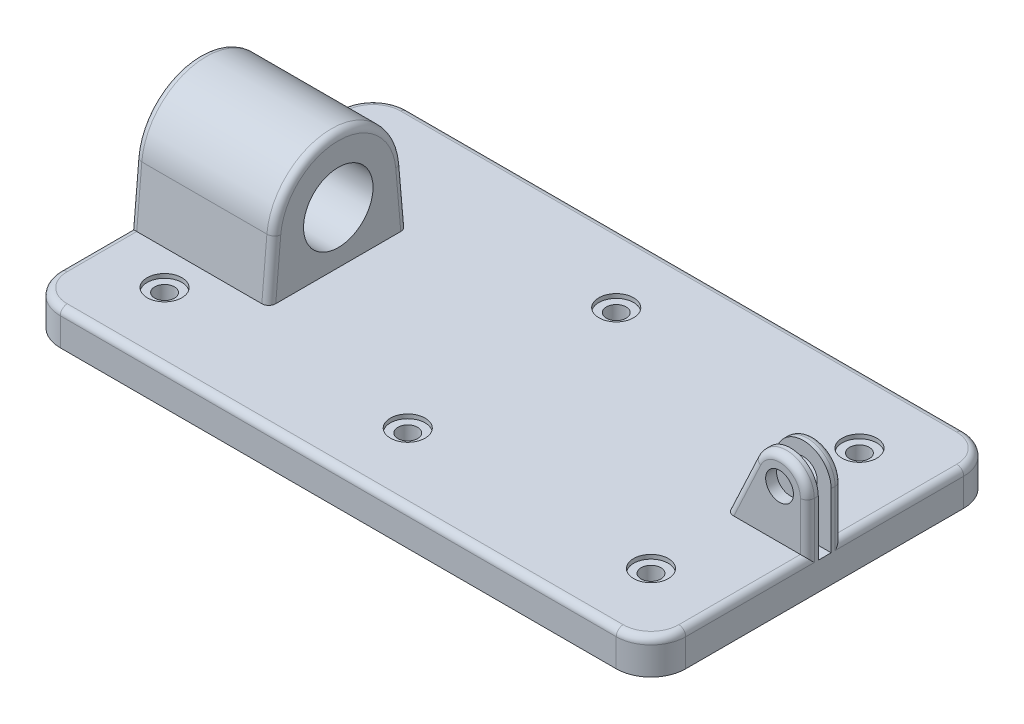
ISO-10303-21;
HEADER;
FILE_DESCRIPTION(('STEP AP214'),'2;1');
FILE_NAME('part.step','',(''),(''),'','','');
FILE_SCHEMA(('AUTOMOTIVE_DESIGN { 1 0 10303 214 1 1 1 1 }'));
ENDSEC;
DATA;
#1=APPLICATION_CONTEXT('core data for automotive mechanical design processes');
#2=APPLICATION_PROTOCOL_DEFINITION('international standard','automotive_design',2000,#1);
#3=PRODUCT_CONTEXT('',#1,'mechanical');
#4=PRODUCT('Part','Part','',(#3));
#5=PRODUCT_RELATED_PRODUCT_CATEGORY('part','',(#4));
#6=PRODUCT_DEFINITION_FORMATION('','',#4);
#7=PRODUCT_DEFINITION_CONTEXT('part definition',#1,'design');
#8=PRODUCT_DEFINITION('design','',#6,#7);
#9=PRODUCT_DEFINITION_SHAPE('','',#8);
#10=(LENGTH_UNIT() NAMED_UNIT(*) SI_UNIT(.MILLI.,.METRE.));
#11=(NAMED_UNIT(*) PLANE_ANGLE_UNIT() SI_UNIT($,.RADIAN.));
#12=(NAMED_UNIT(*) SI_UNIT($,.STERADIAN.) SOLID_ANGLE_UNIT());
#13=UNCERTAINTY_MEASURE_WITH_UNIT(LENGTH_MEASURE(1.E-05),#10,'distance_accuracy_value','');
#14=(GEOMETRIC_REPRESENTATION_CONTEXT(3) GLOBAL_UNCERTAINTY_ASSIGNED_CONTEXT((#13)) GLOBAL_UNIT_ASSIGNED_CONTEXT((#10,
#11,#12)) REPRESENTATION_CONTEXT('',''));
#15=CARTESIAN_POINT('',(0.,0.,0.));
#16=DIRECTION('',(0.,0.,1.));
#17=DIRECTION('',(1.,0.,0.));
#18=AXIS2_PLACEMENT_3D('',#15,#16,#17);
#19=CARTESIAN_POINT('',(109.22,15.24,3.175));
#20=DIRECTION('',(0.,0.,-1.));
#21=DIRECTION('',(-1.,0.,0.));
#22=AXIS2_PLACEMENT_3D('',#19,#20,#21);
#23=CYLINDRICAL_SURFACE('',#22,5.08000000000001);
#24=CARTESIAN_POINT('',(109.22,15.24,-1.175));
#25=DIRECTION('',(0.,0.,-1.));
#26=DIRECTION('',(-1.,0.,0.));
#27=AXIS2_PLACEMENT_3D('',#24,#25,#26);
#28=CIRCLE('',#27,5.08000000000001);
#29=CARTESIAN_POINT('',(104.615956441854,17.3869007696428,-1.175));
#30=VERTEX_POINT('',#29);
#31=CARTESIAN_POINT('',(114.3,15.24,-1.175));
#32=VERTEX_POINT('',#31);
#33=EDGE_CURVE('E293',#30,#32,#28,.T.);
#34=ORIENTED_EDGE('',*,*,#33,.T.);
#35=DIRECTION('',(0.,0.,-1.));
#36=VECTOR('',#35,1.);
#37=CARTESIAN_POINT('',(114.3,15.24,3.175));
#38=LINE('',#37,#36);
#39=CARTESIAN_POINT('',(114.3,15.24,-1.905));
#40=VERTEX_POINT('',#39);
#41=EDGE_CURVE('E618',#32,#40,#38,.T.);
#42=ORIENTED_EDGE('',*,*,#41,.T.);
#43=CARTESIAN_POINT('',(109.22,15.24,-1.905));
#44=DIRECTION('',(0.,0.,1.));
#45=DIRECTION('',(1.,0.,0.));
#46=AXIS2_PLACEMENT_3D('',#43,#44,#45);
#47=CIRCLE('',#46,5.08000000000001);
#48=CARTESIAN_POINT('',(104.615956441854,17.3869007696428,-1.905));
#49=VERTEX_POINT('',#48);
#50=EDGE_CURVE('E489',#40,#49,#47,.T.);
#51=ORIENTED_EDGE('',*,*,#50,.T.);
#52=DIRECTION('',(0.,0.,-1.));
#53=VECTOR('',#52,1.);
#54=CARTESIAN_POINT('',(104.615956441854,17.3869007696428,3.175));
#55=LINE('',#54,#53);
#56=EDGE_CURVE('E705',#30,#49,#55,.T.);
#57=ORIENTED_EDGE('',*,*,#56,.F.);
#58=EDGE_LOOP('',(#34,#42,#51,#57));
#59=FACE_BOUND('',#58,.T.);
#60=ADVANCED_FACE('F36',(#59),#23,.T.);
#61=CARTESIAN_POINT('',(104.615956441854,17.3869007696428,3.175));
#62=DIRECTION('',(0.906307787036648,-0.422618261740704,0.));
#63=DIRECTION('',(0.422618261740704,0.906307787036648,0.));
#64=AXIS2_PLACEMENT_3D('',#61,#62,#63);
#65=PLANE('',#64);
#66=DIRECTION('',(0.,0.,-1.));
#67=VECTOR('',#66,1.);
#68=CARTESIAN_POINT('',(99.4693650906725,6.34999999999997,3.175));
#69=LINE('',#68,#67);
#70=CARTESIAN_POINT('',(99.4693650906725,6.34999999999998,-1.175));
#71=VERTEX_POINT('',#70);
#72=CARTESIAN_POINT('',(99.4693650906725,6.34999999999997,-1.905));
#73=VERTEX_POINT('',#72);
#74=EDGE_CURVE('E709',#71,#73,#69,.T.);
#75=ORIENTED_EDGE('',*,*,#74,.F.);
#76=DIRECTION('',(0.422618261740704,0.906307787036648,0.));
#77=VECTOR('',#76,1.);
#78=CARTESIAN_POINT('',(104.615956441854,17.3869007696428,-1.175));
#79=LINE('',#78,#77);
#80=EDGE_CURVE('E290',#71,#30,#79,.T.);
#81=ORIENTED_EDGE('',*,*,#80,.T.);
#82=ORIENTED_EDGE('',*,*,#56,.T.);
#83=DIRECTION('',(-0.422618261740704,-0.906307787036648,0.));
#84=VECTOR('',#83,1.);
#85=CARTESIAN_POINT('',(104.615956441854,17.3869007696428,-1.905));
#86=LINE('',#85,#84);
#87=EDGE_CURVE('E455',#49,#73,#86,.T.);
#88=ORIENTED_EDGE('',*,*,#87,.T.);
#89=EDGE_LOOP('',(#75,#81,#82,#88));
#90=FACE_BOUND('',#89,.T.);
#91=ADVANCED_FACE('F591',(#90),#65,.F.);
#92=CARTESIAN_POINT('',(109.22,15.24,3.175));
#93=DIRECTION('',(0.,0.,1.));
#94=DIRECTION('',(1.,0.,0.));
#95=AXIS2_PLACEMENT_3D('',#92,#93,#94);
#96=CYLINDRICAL_SURFACE('',#95,2.54);
#97=CARTESIAN_POINT('',(109.22,15.24,-1.175));
#98=DIRECTION('',(0.,0.,-1.));
#99=DIRECTION('',(-1.,0.,0.));
#100=AXIS2_PLACEMENT_3D('',#97,#98,#99);
#101=CIRCLE('',#100,2.54);
#102=CARTESIAN_POINT('',(106.68,15.24,-1.175));
#103=VERTEX_POINT('',#102);
#104=EDGE_CURVE('E40',#103,#103,#101,.T.);
#105=ORIENTED_EDGE('',*,*,#104,.F.);
#106=EDGE_LOOP('',(#105));
#107=FACE_BOUND('',#106,.T.);
#108=CARTESIAN_POINT('',(109.22,15.24,-3.175));
#109=DIRECTION('',(0.,0.,1.));
#110=DIRECTION('',(1.,0.,0.));
#111=AXIS2_PLACEMENT_3D('',#108,#109,#110);
#112=CIRCLE('',#111,2.54);
#113=CARTESIAN_POINT('',(111.76,15.24,-3.175));
#114=VERTEX_POINT('',#113);
#115=EDGE_CURVE('E378',#114,#114,#112,.F.);
#116=ORIENTED_EDGE('',*,*,#115,.T.);
#117=EDGE_LOOP('',(#116));
#118=FACE_BOUND('',#117,.T.);
#119=ADVANCED_FACE('F571',(#107,#118),#96,.F.);
#120=CARTESIAN_POINT('',(114.3,6.34999999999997,31.75));
#121=DIRECTION('',(0.,-1.,0.));
#122=DIRECTION('',(1.,0.,0.));
#123=AXIS2_PLACEMENT_3D('',#120,#121,#122);
#124=PLANE('',#123);
#125=DIRECTION('',(1.,0.,0.));
#126=VECTOR('',#125,1.);
#127=CARTESIAN_POINT('',(99.4693650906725,6.34999999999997,-3.175));
#128=LINE('',#127,#126);
#129=CARTESIAN_POINT('',(100.870655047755,6.34999999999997,-3.175));
#130=VERTEX_POINT('',#129);
#131=CARTESIAN_POINT('',(113.03,6.34999999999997,-3.175));
#132=VERTEX_POINT('',#131);
#133=EDGE_CURVE('E388',#130,#132,#128,.T.);
#134=ORIENTED_EDGE('',*,*,#133,.T.);
#135=DIRECTION('',(0.,0.,-1.));
#136=VECTOR('',#135,1.);
#137=CARTESIAN_POINT('',(113.03,6.34999999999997,-25.4));
#138=LINE('',#137,#136);
#139=CARTESIAN_POINT('',(113.03,6.34999999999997,-25.4));
#140=VERTEX_POINT('',#139);
#141=EDGE_CURVE('E427',#132,#140,#138,.T.);
#142=ORIENTED_EDGE('',*,*,#141,.T.);
#143=CARTESIAN_POINT('',(107.95,6.34999999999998,-25.4));
#144=DIRECTION('',(0.,-1.,0.));
#145=DIRECTION('',(1.,0.,0.));
#146=AXIS2_PLACEMENT_3D('',#143,#144,#145);
#147=CIRCLE('',#146,5.08);
#148=CARTESIAN_POINT('',(107.95,6.34999999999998,-30.48));
#149=VERTEX_POINT('',#148);
#150=EDGE_CURVE('E423',#140,#149,#147,.F.);
#151=ORIENTED_EDGE('',*,*,#150,.T.);
#152=DIRECTION('',(-1.,0.,0.));
#153=VECTOR('',#152,1.);
#154=CARTESIAN_POINT('',(6.34999999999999,6.35000000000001,-30.48));
#155=LINE('',#154,#153);
#156=CARTESIAN_POINT('',(6.35,6.35000000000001,-30.48));
#157=VERTEX_POINT('',#156);
#158=EDGE_CURVE('E419',#149,#157,#155,.T.);
#159=ORIENTED_EDGE('',*,*,#158,.T.);
#160=CARTESIAN_POINT('',(6.35,6.35000000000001,-25.4));
#161=DIRECTION('',(0.,-1.,0.));
#162=DIRECTION('',(1.,0.,0.));
#163=AXIS2_PLACEMENT_3D('',#160,#161,#162);
#164=CIRCLE('',#163,5.08);
#165=CARTESIAN_POINT('',(1.27,6.35000000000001,-25.4));
#166=VERTEX_POINT('',#165);
#167=EDGE_CURVE('E421',#157,#166,#164,.F.);
#168=ORIENTED_EDGE('',*,*,#167,.T.);
#169=DIRECTION('',(0.,0.,-1.));
#170=VECTOR('',#169,1.);
#171=CARTESIAN_POINT('',(1.27,6.35000000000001,-12.7));
#172=LINE('',#171,#170);
#173=CARTESIAN_POINT('',(1.27,6.35000000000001,-12.7));
#174=VERTEX_POINT('',#173);
#175=EDGE_CURVE('E425',#166,#174,#172,.F.);
#176=ORIENTED_EDGE('',*,*,#175,.T.);
#177=DIRECTION('',(-1.,0.,0.));
#178=VECTOR('',#177,1.);
#179=CARTESIAN_POINT('',(25.4,6.35000000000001,-12.7));
#180=LINE('',#179,#178);
#181=CARTESIAN_POINT('',(24.13,6.35000000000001,-12.7));
#182=VERTEX_POINT('',#181);
#183=EDGE_CURVE('E385',#182,#174,#180,.T.);
#184=ORIENTED_EDGE('',*,*,#183,.F.);
#185=CARTESIAN_POINT('',(24.13,6.35,-11.4251488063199));
#186=DIRECTION('',(0.,-1.,0.));
#187=DIRECTION('',(0.,0.,-1.));
#188=AXIS2_PLACEMENT_3D('',#185,#186,#187);
#189=ELLIPSE('',#188,1.27485119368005,1.27);
#190=CARTESIAN_POINT('',(25.4,6.35000000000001,-11.4251488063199));
#191=VERTEX_POINT('',#190);
#192=EDGE_CURVE('E45',#182,#191,#189,.T.);
#193=ORIENTED_EDGE('',*,*,#192,.T.);
#194=DIRECTION('',(0.,0.,1.));
#195=VECTOR('',#194,1.);
#196=CARTESIAN_POINT('',(25.4,6.35000000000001,-12.7));
#197=LINE('',#196,#195);
#198=CARTESIAN_POINT('',(25.4,6.35000000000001,11.4251488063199));
#199=VERTEX_POINT('',#198);
#200=EDGE_CURVE('E381',#191,#199,#197,.T.);
#201=ORIENTED_EDGE('',*,*,#200,.T.);
#202=CARTESIAN_POINT('',(24.13,6.35,11.4251488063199));
#203=DIRECTION('',(0.,-1.,0.));
#204=DIRECTION('',(0.,0.,-1.));
#205=AXIS2_PLACEMENT_3D('',#202,#203,#204);
#206=ELLIPSE('',#205,1.27485119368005,1.27);
#207=CARTESIAN_POINT('',(24.13,6.35000000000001,12.7));
#208=VERTEX_POINT('',#207);
#209=EDGE_CURVE('E11',#199,#208,#206,.T.);
#210=ORIENTED_EDGE('',*,*,#209,.T.);
#211=DIRECTION('',(-1.,0.,0.));
#212=VECTOR('',#211,1.);
#213=CARTESIAN_POINT('',(25.4,6.35000000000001,12.7));
#214=LINE('',#213,#212);
#215=CARTESIAN_POINT('',(1.27,6.35000000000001,12.7));
#216=VERTEX_POINT('',#215);
#217=EDGE_CURVE('E384',#208,#216,#214,.T.);
#218=ORIENTED_EDGE('',*,*,#217,.T.);
#219=DIRECTION('',(0.,0.,-1.));
#220=VECTOR('',#219,1.);
#221=CARTESIAN_POINT('',(1.27,6.35000000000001,25.4));
#222=LINE('',#221,#220);
#223=CARTESIAN_POINT('',(1.27,6.35000000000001,25.4));
#224=VERTEX_POINT('',#223);
#225=EDGE_CURVE('E415',#216,#224,#222,.F.);
#226=ORIENTED_EDGE('',*,*,#225,.T.);
#227=CARTESIAN_POINT('',(6.35,6.35000000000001,25.4));
#228=DIRECTION('',(0.,-1.,0.));
#229=DIRECTION('',(1.,0.,0.));
#230=AXIS2_PLACEMENT_3D('',#227,#228,#229);
#231=CIRCLE('',#230,5.08);
#232=CARTESIAN_POINT('',(6.35,6.35000000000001,30.48));
#233=VERTEX_POINT('',#232);
#234=EDGE_CURVE('E410',#224,#233,#231,.F.);
#235=ORIENTED_EDGE('',*,*,#234,.T.);
#236=DIRECTION('',(-1.,0.,0.));
#237=VECTOR('',#236,1.);
#238=CARTESIAN_POINT('',(114.3,6.34999999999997,30.48));
#239=LINE('',#238,#237);
#240=CARTESIAN_POINT('',(107.95,6.34999999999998,30.48));
#241=VERTEX_POINT('',#240);
#242=EDGE_CURVE('E408',#233,#241,#239,.F.);
#243=ORIENTED_EDGE('',*,*,#242,.T.);
#244=CARTESIAN_POINT('',(107.95,6.34999999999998,25.4));
#245=DIRECTION('',(0.,-1.,0.));
#246=DIRECTION('',(1.,0.,0.));
#247=AXIS2_PLACEMENT_3D('',#244,#245,#246);
#248=CIRCLE('',#247,5.08);
#249=CARTESIAN_POINT('',(113.03,6.34999999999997,25.4));
#250=VERTEX_POINT('',#249);
#251=EDGE_CURVE('E413',#241,#250,#248,.F.);
#252=ORIENTED_EDGE('',*,*,#251,.T.);
#253=DIRECTION('',(0.,0.,-1.));
#254=VECTOR('',#253,1.);
#255=CARTESIAN_POINT('',(113.03,6.34999999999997,3.175));
#256=LINE('',#255,#254);
#257=CARTESIAN_POINT('',(113.03,6.34999999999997,3.175));
#258=VERTEX_POINT('',#257);
#259=EDGE_CURVE('E417',#250,#258,#256,.T.);
#260=ORIENTED_EDGE('',*,*,#259,.T.);
#261=DIRECTION('',(1.,0.,0.));
#262=VECTOR('',#261,1.);
#263=CARTESIAN_POINT('',(99.4693650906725,6.34999999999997,3.175));
#264=LINE('',#263,#262);
#265=CARTESIAN_POINT('',(100.870655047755,6.34999999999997,3.175));
#266=VERTEX_POINT('',#265);
#267=EDGE_CURVE('E405',#266,#258,#264,.T.);
#268=ORIENTED_EDGE('',*,*,#267,.F.);
#269=CARTESIAN_POINT('',(100.870655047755,6.34999999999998,1.905));
#270=DIRECTION('',(0.,-1.,0.));
#271=DIRECTION('',(1.,0.,0.));
#272=AXIS2_PLACEMENT_3D('',#269,#270,#271);
#273=ELLIPSE('',#272,1.40128995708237,1.27);
#274=CARTESIAN_POINT('',(99.4693650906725,6.34999999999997,1.905));
#275=VERTEX_POINT('',#274);
#276=EDGE_CURVE('E501',#266,#275,#273,.T.);
#277=ORIENTED_EDGE('',*,*,#276,.T.);
#278=CARTESIAN_POINT('',(99.4693650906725,6.34999999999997,1.175));
#279=VERTEX_POINT('',#278);
#280=EDGE_CURVE('E399',#275,#279,#69,.T.);
#281=ORIENTED_EDGE('',*,*,#280,.T.);
#282=EDGE_CURVE('E713',#279,#71,#69,.T.);
#283=ORIENTED_EDGE('',*,*,#282,.T.);
#284=ORIENTED_EDGE('',*,*,#74,.T.);
#285=CARTESIAN_POINT('',(100.870655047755,6.34999999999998,-1.905));
#286=DIRECTION('',(0.,-1.,0.));
#287=DIRECTION('',(-1.,0.,0.));
#288=AXIS2_PLACEMENT_3D('',#285,#286,#287);
#289=ELLIPSE('',#288,1.40128995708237,1.27);
#290=EDGE_CURVE('E503',#73,#130,#289,.T.);
#291=ORIENTED_EDGE('',*,*,#290,.T.);
#292=EDGE_LOOP('',(#134,#142,#151,#159,#168,#176,#184,#193,#201,#210,#218,#226,#235,#243,#252,
#260,#268,#277,#281,#283,#284,#291));
#293=FACE_BOUND('',#292,.T.);
#294=CARTESIAN_POINT('',(101.6,6.34999999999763,19.05));
#295=DIRECTION('',(0.,1.,0.));
#296=DIRECTION('',(0.,0.,1.));
#297=AXIS2_PLACEMENT_3D('',#294,#295,#296);
#298=CIRCLE('',#297,3.17499999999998);
#299=CARTESIAN_POINT('',(101.6,6.34999999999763,22.225));
#300=VERTEX_POINT('',#299);
#301=EDGE_CURVE('E366',#300,#300,#298,.T.);
#302=ORIENTED_EDGE('',*,*,#301,.F.);
#303=EDGE_LOOP('',(#302));
#304=FACE_BOUND('',#303,.T.);
#305=CARTESIAN_POINT('',(101.6,6.34999999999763,-19.05));
#306=DIRECTION('',(0.,1.,0.));
#307=DIRECTION('',(0.,0.,1.));
#308=AXIS2_PLACEMENT_3D('',#305,#306,#307);
#309=CIRCLE('',#308,3.17499999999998);
#310=CARTESIAN_POINT('',(101.6,6.34999999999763,-15.875));
#311=VERTEX_POINT('',#310);
#312=EDGE_CURVE('E354',#311,#311,#309,.T.);
#313=ORIENTED_EDGE('',*,*,#312,.F.);
#314=EDGE_LOOP('',(#313));
#315=FACE_BOUND('',#314,.T.);
#316=CARTESIAN_POINT('',(57.15,6.34999999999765,19.05));
#317=DIRECTION('',(0.,1.,0.));
#318=DIRECTION('',(0.,0.,1.));
#319=AXIS2_PLACEMENT_3D('',#316,#317,#318);
#320=CIRCLE('',#319,3.17499999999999);
#321=CARTESIAN_POINT('',(57.15,6.34999999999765,22.225));
#322=VERTEX_POINT('',#321);
#323=EDGE_CURVE('E342',#322,#322,#320,.T.);
#324=ORIENTED_EDGE('',*,*,#323,.F.);
#325=EDGE_LOOP('',(#324));
#326=FACE_BOUND('',#325,.T.);
#327=CARTESIAN_POINT('',(57.15,6.34999999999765,-19.05));
#328=DIRECTION('',(0.,1.,0.));
#329=DIRECTION('',(0.,0.,1.));
#330=AXIS2_PLACEMENT_3D('',#327,#328,#329);
#331=CIRCLE('',#330,3.17499999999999);
#332=CARTESIAN_POINT('',(57.15,6.34999999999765,-15.875));
#333=VERTEX_POINT('',#332);
#334=EDGE_CURVE('E330',#333,#333,#331,.T.);
#335=ORIENTED_EDGE('',*,*,#334,.F.);
#336=EDGE_LOOP('',(#335));
#337=FACE_BOUND('',#336,.T.);
#338=CARTESIAN_POINT('',(12.7,6.34999999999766,19.05));
#339=DIRECTION('',(0.,1.,0.));
#340=DIRECTION('',(0.,0.,1.));
#341=AXIS2_PLACEMENT_3D('',#338,#339,#340);
#342=CIRCLE('',#341,3.17499999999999);
#343=CARTESIAN_POINT('',(12.7,6.34999999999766,22.225));
#344=VERTEX_POINT('',#343);
#345=EDGE_CURVE('E318',#344,#344,#342,.T.);
#346=ORIENTED_EDGE('',*,*,#345,.F.);
#347=EDGE_LOOP('',(#346));
#348=FACE_BOUND('',#347,.T.);
#349=CARTESIAN_POINT('',(12.7,6.34999999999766,-19.05));
#350=DIRECTION('',(0.,1.,0.));
#351=DIRECTION('',(0.,0.,1.));
#352=AXIS2_PLACEMENT_3D('',#349,#350,#351);
#353=CIRCLE('',#352,3.17499999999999);
#354=CARTESIAN_POINT('',(12.7,6.34999999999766,-15.875));
#355=VERTEX_POINT('',#354);
#356=EDGE_CURVE('E306',#355,#355,#353,.T.);
#357=ORIENTED_EDGE('',*,*,#356,.F.);
#358=EDGE_LOOP('',(#357));
#359=FACE_BOUND('',#358,.T.);
#360=ADVANCED_FACE('F689',(#293,#304,#315,#326,#337,#348,#359),#124,.F.);
#361=CARTESIAN_POINT('',(0.,0.,31.75));
#362=DIRECTION('',(0.,1.,0.));
#363=DIRECTION('',(-1.,0.,0.));
#364=AXIS2_PLACEMENT_3D('',#361,#362,#363);
#365=PLANE('',#364);
#366=CARTESIAN_POINT('',(12.7,0.,-19.05));
#367=DIRECTION('',(0.,1.,0.));
#368=DIRECTION('',(0.,0.,1.));
#369=AXIS2_PLACEMENT_3D('',#366,#367,#368);
#370=CIRCLE('',#369,1.80339999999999);
#371=CARTESIAN_POINT('',(12.7,0.,-17.2466));
#372=VERTEX_POINT('',#371);
#373=EDGE_CURVE('E296',#372,#372,#370,.T.);
#374=ORIENTED_EDGE('',*,*,#373,.T.);
#375=EDGE_LOOP('',(#374));
#376=FACE_BOUND('',#375,.T.);
#377=CARTESIAN_POINT('',(57.15,0.,-19.05));
#378=DIRECTION('',(0.,1.,0.));
#379=DIRECTION('',(0.,0.,1.));
#380=AXIS2_PLACEMENT_3D('',#377,#378,#379);
#381=CIRCLE('',#380,1.80339999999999);
#382=CARTESIAN_POINT('',(57.15,0.,-17.2466));
#383=VERTEX_POINT('',#382);
#384=EDGE_CURVE('E321',#383,#383,#381,.T.);
#385=ORIENTED_EDGE('',*,*,#384,.T.);
#386=EDGE_LOOP('',(#385));
#387=FACE_BOUND('',#386,.T.);
#388=CARTESIAN_POINT('',(57.15,0.,19.05));
#389=DIRECTION('',(0.,1.,0.));
#390=DIRECTION('',(0.,0.,1.));
#391=AXIS2_PLACEMENT_3D('',#388,#389,#390);
#392=CIRCLE('',#391,1.80339999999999);
#393=CARTESIAN_POINT('',(57.15,0.,20.8534));
#394=VERTEX_POINT('',#393);
#395=EDGE_CURVE('E333',#394,#394,#392,.T.);
#396=ORIENTED_EDGE('',*,*,#395,.T.);
#397=EDGE_LOOP('',(#396));
#398=FACE_BOUND('',#397,.T.);
#399=DIRECTION('',(0.,0.,-1.));
#400=VECTOR('',#399,1.);
#401=CARTESIAN_POINT('',(0.,0.,31.75));
#402=LINE('',#401,#400);
#403=CARTESIAN_POINT('',(0.,0.,25.4));
#404=VERTEX_POINT('',#403);
#405=CARTESIAN_POINT('',(0.,0.,-25.4));
#406=VERTEX_POINT('',#405);
#407=EDGE_CURVE('E628',#404,#406,#402,.T.);
#408=ORIENTED_EDGE('',*,*,#407,.T.);
#409=CARTESIAN_POINT('',(6.35,0.,-25.4));
#410=DIRECTION('',(0.,1.,0.));
#411=DIRECTION('',(-1.,0.,0.));
#412=AXIS2_PLACEMENT_3D('',#409,#410,#411);
#413=CIRCLE('',#412,6.35);
#414=CARTESIAN_POINT('',(6.35,0.,-31.75));
#415=VERTEX_POINT('',#414);
#416=EDGE_CURVE('E650',#406,#415,#413,.F.);
#417=ORIENTED_EDGE('',*,*,#416,.T.);
#418=DIRECTION('',(1.,0.,0.));
#419=VECTOR('',#418,1.);
#420=CARTESIAN_POINT('',(0.,0.,-31.75));
#421=LINE('',#420,#419);
#422=CARTESIAN_POINT('',(107.95,0.,-31.75));
#423=VERTEX_POINT('',#422);
#424=EDGE_CURVE('E617',#415,#423,#421,.T.);
#425=ORIENTED_EDGE('',*,*,#424,.T.);
#426=CARTESIAN_POINT('',(107.95,0.,-25.4));
#427=DIRECTION('',(0.,1.,0.));
#428=DIRECTION('',(-1.,0.,0.));
#429=AXIS2_PLACEMENT_3D('',#426,#427,#428);
#430=CIRCLE('',#429,6.35);
#431=CARTESIAN_POINT('',(114.3,0.,-25.4));
#432=VERTEX_POINT('',#431);
#433=EDGE_CURVE('E644',#423,#432,#430,.F.);
#434=ORIENTED_EDGE('',*,*,#433,.T.);
#435=DIRECTION('',(0.,0.,-1.));
#436=VECTOR('',#435,1.);
#437=CARTESIAN_POINT('',(114.3,0.,31.75));
#438=LINE('',#437,#436);
#439=CARTESIAN_POINT('',(114.3,0.,25.4));
#440=VERTEX_POINT('',#439);
#441=EDGE_CURVE('E626',#440,#432,#438,.T.);
#442=ORIENTED_EDGE('',*,*,#441,.F.);
#443=CARTESIAN_POINT('',(107.95,0.,25.4));
#444=DIRECTION('',(0.,1.,0.));
#445=DIRECTION('',(-1.,0.,0.));
#446=AXIS2_PLACEMENT_3D('',#443,#444,#445);
#447=CIRCLE('',#446,6.35);
#448=CARTESIAN_POINT('',(107.95,0.,31.75));
#449=VERTEX_POINT('',#448);
#450=EDGE_CURVE('E646',#440,#449,#447,.F.);
#451=ORIENTED_EDGE('',*,*,#450,.T.);
#452=DIRECTION('',(1.,0.,0.));
#453=VECTOR('',#452,1.);
#454=CARTESIAN_POINT('',(0.,0.,31.75));
#455=LINE('',#454,#453);
#456=CARTESIAN_POINT('',(6.35,0.,31.75));
#457=VERTEX_POINT('',#456);
#458=EDGE_CURVE('E621',#457,#449,#455,.T.);
#459=ORIENTED_EDGE('',*,*,#458,.F.);
#460=CARTESIAN_POINT('',(6.35,0.,25.4));
#461=DIRECTION('',(0.,1.,0.));
#462=DIRECTION('',(-1.,0.,0.));
#463=AXIS2_PLACEMENT_3D('',#460,#461,#462);
#464=CIRCLE('',#463,6.35);
#465=EDGE_CURVE('E648',#457,#404,#464,.F.);
#466=ORIENTED_EDGE('',*,*,#465,.T.);
#467=EDGE_LOOP('',(#408,#417,#425,#434,#442,#451,#459,#466));
#468=FACE_BOUND('',#467,.T.);
#469=CARTESIAN_POINT('',(101.6,0.,19.05));
#470=DIRECTION('',(0.,1.,0.));
#471=DIRECTION('',(0.,0.,1.));
#472=AXIS2_PLACEMENT_3D('',#469,#470,#471);
#473=CIRCLE('',#472,1.80339999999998);
#474=CARTESIAN_POINT('',(101.6,0.,20.8534));
#475=VERTEX_POINT('',#474);
#476=EDGE_CURVE('E357',#475,#475,#473,.T.);
#477=ORIENTED_EDGE('',*,*,#476,.T.);
#478=EDGE_LOOP('',(#477));
#479=FACE_BOUND('',#478,.T.);
#480=CARTESIAN_POINT('',(101.6,0.,-19.05));
#481=DIRECTION('',(0.,1.,0.));
#482=DIRECTION('',(0.,0.,1.));
#483=AXIS2_PLACEMENT_3D('',#480,#481,#482);
#484=CIRCLE('',#483,1.80339999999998);
#485=CARTESIAN_POINT('',(101.6,0.,-17.2466));
#486=VERTEX_POINT('',#485);
#487=EDGE_CURVE('E345',#486,#486,#484,.T.);
#488=ORIENTED_EDGE('',*,*,#487,.T.);
#489=EDGE_LOOP('',(#488));
#490=FACE_BOUND('',#489,.T.);
#491=CARTESIAN_POINT('',(12.7,0.,19.05));
#492=DIRECTION('',(0.,1.,0.));
#493=DIRECTION('',(0.,0.,1.));
#494=AXIS2_PLACEMENT_3D('',#491,#492,#493);
#495=CIRCLE('',#494,1.80339999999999);
#496=CARTESIAN_POINT('',(12.7,0.,20.8534));
#497=VERTEX_POINT('',#496);
#498=EDGE_CURVE('E309',#497,#497,#495,.T.);
#499=ORIENTED_EDGE('',*,*,#498,.T.);
#500=EDGE_LOOP('',(#499));
#501=FACE_BOUND('',#500,.T.);
#502=ADVANCED_FACE('F669',(#376,#387,#398,#468,#479,#490,#501),#365,.F.);
#503=CARTESIAN_POINT('',(0.,0.,31.75));
#504=DIRECTION('',(-1.,0.,0.));
#505=DIRECTION('',(0.,0.,1.));
#506=AXIS2_PLACEMENT_3D('',#503,#504,#505);
#507=PLANE('',#506);
#508=DIRECTION('',(0.,0.996194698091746,0.0871557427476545));
#509=VECTOR('',#508,1.);
#510=CARTESIAN_POINT('',(0.,6.23931220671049,-11.4348327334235));
#511=LINE('',#510,#509);
#512=CARTESIAN_POINT('',(0.,16.7946250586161,-10.5113625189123));
#513=VERTEX_POINT('',#512);
#514=CARTESIAN_POINT('',(0.,5.08000000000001,-11.5362594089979));
#515=VERTEX_POINT('',#514);
#516=EDGE_CURVE('E443',#513,#515,#511,.F.);
#517=ORIENTED_EDGE('',*,*,#516,.T.);
#518=DIRECTION('',(0.,0.,-1.));
#519=VECTOR('',#518,1.);
#520=CARTESIAN_POINT('',(0.,5.08000000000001,-25.4));
#521=LINE('',#520,#519);
#522=CARTESIAN_POINT('',(0.,5.08000000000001,-25.4));
#523=VERTEX_POINT('',#522);
#524=EDGE_CURVE('E447',#515,#523,#521,.T.);
#525=ORIENTED_EDGE('',*,*,#524,.T.);
#526=DIRECTION('',(0.,1.,0.));
#527=VECTOR('',#526,1.);
#528=CARTESIAN_POINT('',(0.,0.,-25.4));
#529=LINE('',#528,#527);
#530=EDGE_CURVE('E642',#523,#406,#529,.F.);
#531=ORIENTED_EDGE('',*,*,#530,.T.);
#532=ORIENTED_EDGE('',*,*,#407,.F.);
#533=DIRECTION('',(0.,1.,0.));
#534=VECTOR('',#533,1.);
#535=CARTESIAN_POINT('',(0.,6.35000000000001,25.4));
#536=LINE('',#535,#534);
#537=CARTESIAN_POINT('',(0.,5.08000000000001,25.4));
#538=VERTEX_POINT('',#537);
#539=EDGE_CURVE('E639',#404,#538,#536,.T.);
#540=ORIENTED_EDGE('',*,*,#539,.T.);
#541=DIRECTION('',(0.,0.,-1.));
#542=VECTOR('',#541,1.);
#543=CARTESIAN_POINT('',(0.,5.08000000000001,12.7));
#544=LINE('',#543,#542);
#545=CARTESIAN_POINT('',(0.,5.08000000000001,11.5362594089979));
#546=VERTEX_POINT('',#545);
#547=EDGE_CURVE('E445',#538,#546,#544,.T.);
#548=ORIENTED_EDGE('',*,*,#547,.T.);
#549=DIRECTION('',(0.,0.996194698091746,-0.0871557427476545));
#550=VECTOR('',#549,1.);
#551=CARTESIAN_POINT('',(0.,-1.71645130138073,12.1308718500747));
#552=LINE('',#551,#550);
#553=CARTESIAN_POINT('',(0.,16.7946250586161,10.5113625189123));
#554=VERTEX_POINT('',#553);
#555=EDGE_CURVE('E441',#546,#554,#552,.T.);
#556=ORIENTED_EDGE('',*,*,#555,.T.);
#557=CARTESIAN_POINT('',(0.,15.875,0.));
#558=DIRECTION('',(-1.,0.,0.));
#559=DIRECTION('',(0.,0.,1.));
#560=AXIS2_PLACEMENT_3D('',#557,#558,#559);
#561=CIRCLE('',#560,10.5515142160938);
#562=EDGE_CURVE('E439',#554,#513,#561,.T.);
#563=ORIENTED_EDGE('',*,*,#562,.T.);
#564=EDGE_LOOP('',(#517,#525,#531,#532,#540,#548,#556,#563));
#565=FACE_BOUND('',#564,.T.);
#566=CARTESIAN_POINT('',(0.,15.875,0.));
#567=DIRECTION('',(1.,0.,0.));
#568=DIRECTION('',(0.,0.,-1.));
#569=AXIS2_PLACEMENT_3D('',#566,#567,#568);
#570=CIRCLE('',#569,6.34999999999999);
#571=CARTESIAN_POINT('',(0.,15.875,-6.34999999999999));
#572=VERTEX_POINT('',#571);
#573=EDGE_CURVE('E369',#572,#572,#570,.T.);
#574=ORIENTED_EDGE('',*,*,#573,.T.);
#575=EDGE_LOOP('',(#574));
#576=FACE_BOUND('',#575,.T.);
#577=ADVANCED_FACE('F741',(#565,#576),#507,.T.);
#578=CARTESIAN_POINT('',(25.4,15.875,0.));
#579=DIRECTION('',(1.,0.,0.));
#580=DIRECTION('',(0.,0.,-1.));
#581=AXIS2_PLACEMENT_3D('',#578,#579,#580);
#582=PLANE('',#581);
#583=ORIENTED_EDGE('',*,*,#200,.F.);
#584=DIRECTION('',(0.,0.996194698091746,0.0871557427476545));
#585=VECTOR('',#584,1.);
#586=CARTESIAN_POINT('',(25.4,16.7946250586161,-10.5113625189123));
#587=LINE('',#586,#585);
#588=CARTESIAN_POINT('',(25.4,16.7946250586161,-10.5113625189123));
#589=VERTEX_POINT('',#588);
#590=EDGE_CURVE('E470',#191,#589,#587,.T.);
#591=ORIENTED_EDGE('',*,*,#590,.T.);
#592=CARTESIAN_POINT('',(25.4,15.875,0.));
#593=DIRECTION('',(1.,0.,0.));
#594=DIRECTION('',(0.,0.,-1.));
#595=AXIS2_PLACEMENT_3D('',#592,#593,#594);
#596=CIRCLE('',#595,10.5515142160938);
#597=CARTESIAN_POINT('',(25.4,16.7946250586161,10.5113625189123));
#598=VERTEX_POINT('',#597);
#599=EDGE_CURVE('E466',#589,#598,#596,.T.);
#600=ORIENTED_EDGE('',*,*,#599,.T.);
#601=DIRECTION('',(0.,0.996194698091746,-0.0871557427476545));
#602=VECTOR('',#601,1.);
#603=CARTESIAN_POINT('',(25.4,16.7946250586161,10.5113625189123));
#604=LINE('',#603,#602);
#605=EDGE_CURVE('E468',#598,#199,#604,.F.);
#606=ORIENTED_EDGE('',*,*,#605,.T.);
#607=EDGE_LOOP('',(#583,#591,#600,#606));
#608=FACE_BOUND('',#607,.T.);
#609=CARTESIAN_POINT('',(25.3999999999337,15.875,0.));
#610=DIRECTION('',(1.,0.,0.));
#611=DIRECTION('',(0.,0.,-1.));
#612=AXIS2_PLACEMENT_3D('',#609,#610,#611);
#613=CIRCLE('',#612,6.34999999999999);
#614=CARTESIAN_POINT('',(25.3999999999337,15.875,-6.34999999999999));
#615=VERTEX_POINT('',#614);
#616=EDGE_CURVE('E372',#615,#615,#613,.T.);
#617=ORIENTED_EDGE('',*,*,#616,.F.);
#618=EDGE_LOOP('',(#617));
#619=FACE_BOUND('',#618,.T.);
#620=ADVANCED_FACE('F585',(#608,#619),#582,.T.);
#621=CARTESIAN_POINT('',(109.22,15.24,-3.175));
#622=DIRECTION('',(0.,0.,1.));
#623=DIRECTION('',(1.,0.,0.));
#624=AXIS2_PLACEMENT_3D('',#621,#622,#623);
#625=PLANE('',#624);
#626=CARTESIAN_POINT('',(109.22,15.24,-3.175));
#627=DIRECTION('',(0.,0.,1.));
#628=DIRECTION('',(1.,0.,0.));
#629=AXIS2_PLACEMENT_3D('',#626,#627,#628);
#630=CIRCLE('',#629,3.81000000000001);
#631=CARTESIAN_POINT('',(105.76696733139,16.8501755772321,-3.175));
#632=VERTEX_POINT('',#631);
#633=CARTESIAN_POINT('',(113.03,15.24,-3.175));
#634=VERTEX_POINT('',#633);
#635=EDGE_CURVE('E460',#632,#634,#630,.F.);
#636=ORIENTED_EDGE('',*,*,#635,.T.);
#637=DIRECTION('',(0.,1.,0.));
#638=VECTOR('',#637,1.);
#639=CARTESIAN_POINT('',(113.03,6.34999999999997,-3.175));
#640=LINE('',#639,#638);
#641=EDGE_CURVE('E464',#634,#132,#640,.F.);
#642=ORIENTED_EDGE('',*,*,#641,.T.);
#643=ORIENTED_EDGE('',*,*,#133,.F.);
#644=DIRECTION('',(-0.422618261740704,-0.906307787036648,0.));
#645=VECTOR('',#644,1.);
#646=CARTESIAN_POINT('',(105.76696733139,16.8501755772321,-3.175));
#647=LINE('',#646,#645);
#648=EDGE_CURVE('E462',#130,#632,#647,.F.);
#649=ORIENTED_EDGE('',*,*,#648,.T.);
#650=EDGE_LOOP('',(#636,#642,#643,#649));
#651=FACE_BOUND('',#650,.T.);
#652=ORIENTED_EDGE('',*,*,#115,.F.);
#653=EDGE_LOOP('',(#652));
#654=FACE_BOUND('',#653,.T.);
#655=ADVANCED_FACE('F576',(#651,#654),#625,.F.);
#656=CARTESIAN_POINT('',(109.22,15.24,3.175));
#657=DIRECTION('',(0.,0.,1.));
#658=DIRECTION('',(1.,0.,0.));
#659=AXIS2_PLACEMENT_3D('',#656,#657,#658);
#660=PLANE('',#659);
#661=ORIENTED_EDGE('',*,*,#267,.T.);
#662=DIRECTION('',(0.,1.,0.));
#663=VECTOR('',#662,1.);
#664=CARTESIAN_POINT('',(113.03,15.24,3.175));
#665=LINE('',#664,#663);
#666=CARTESIAN_POINT('',(113.03,15.24,3.175));
#667=VERTEX_POINT('',#666);
#668=EDGE_CURVE('E453',#258,#667,#665,.T.);
#669=ORIENTED_EDGE('',*,*,#668,.T.);
#670=CARTESIAN_POINT('',(109.22,15.24,3.175));
#671=DIRECTION('',(0.,0.,1.));
#672=DIRECTION('',(1.,0.,0.));
#673=AXIS2_PLACEMENT_3D('',#670,#671,#672);
#674=CIRCLE('',#673,3.81000000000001);
#675=CARTESIAN_POINT('',(105.76696733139,16.8501755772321,3.175));
#676=VERTEX_POINT('',#675);
#677=EDGE_CURVE('E449',#667,#676,#674,.T.);
#678=ORIENTED_EDGE('',*,*,#677,.T.);
#679=DIRECTION('',(-0.422618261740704,-0.906307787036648,0.));
#680=VECTOR('',#679,1.);
#681=CARTESIAN_POINT('',(100.620375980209,5.81327480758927,3.175));
#682=LINE('',#681,#680);
#683=EDGE_CURVE('E451',#676,#266,#682,.T.);
#684=ORIENTED_EDGE('',*,*,#683,.T.);
#685=EDGE_LOOP('',(#661,#669,#678,#684));
#686=FACE_BOUND('',#685,.T.);
#687=CARTESIAN_POINT('',(109.22,15.24,3.175));
#688=DIRECTION('',(0.,0.,1.));
#689=DIRECTION('',(1.,0.,0.));
#690=AXIS2_PLACEMENT_3D('',#687,#688,#689);
#691=CIRCLE('',#690,2.53999999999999);
#692=CARTESIAN_POINT('',(111.76,15.24,3.175));
#693=VERTEX_POINT('',#692);
#694=EDGE_CURVE('E375',#693,#693,#691,.T.);
#695=ORIENTED_EDGE('',*,*,#694,.F.);
#696=EDGE_LOOP('',(#695));
#697=FACE_BOUND('',#696,.T.);
#698=ADVANCED_FACE('F574',(#686,#697),#660,.T.);
#699=CARTESIAN_POINT('',(114.3,6.34999999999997,31.75));
#700=DIRECTION('',(1.,0.,0.));
#701=DIRECTION('',(0.,0.,-1.));
#702=AXIS2_PLACEMENT_3D('',#699,#700,#701);
#703=PLANE('',#702);
#704=DIRECTION('',(0.,-1.,0.));
#705=VECTOR('',#704,1.);
#706=CARTESIAN_POINT('',(114.3,20.32,-1.175));
#707=LINE('',#706,#705);
#708=CARTESIAN_POINT('',(114.3,5.08,-1.175));
#709=VERTEX_POINT('',#708);
#710=EDGE_CURVE('E276',#32,#709,#707,.T.);
#711=ORIENTED_EDGE('',*,*,#710,.T.);
#712=DIRECTION('',(0.,0.,1.));
#713=VECTOR('',#712,1.);
#714=CARTESIAN_POINT('',(114.3,5.08,1.175));
#715=LINE('',#714,#713);
#716=CARTESIAN_POINT('',(114.3,5.08,1.175));
#717=VERTEX_POINT('',#716);
#718=EDGE_CURVE('E267',#709,#717,#715,.T.);
#719=ORIENTED_EDGE('',*,*,#718,.T.);
#720=DIRECTION('',(0.,-1.,0.));
#721=VECTOR('',#720,1.);
#722=CARTESIAN_POINT('',(114.3,20.32,1.175));
#723=LINE('',#722,#721);
#724=CARTESIAN_POINT('',(114.3,15.24,1.175));
#725=VERTEX_POINT('',#724);
#726=EDGE_CURVE('E252',#725,#717,#723,.T.);
#727=ORIENTED_EDGE('',*,*,#726,.F.);
#728=CARTESIAN_POINT('',(114.3,15.24,1.905));
#729=VERTEX_POINT('',#728);
#730=EDGE_CURVE('E613',#729,#725,#38,.T.);
#731=ORIENTED_EDGE('',*,*,#730,.F.);
#732=DIRECTION('',(0.,1.,0.));
#733=VECTOR('',#732,1.);
#734=CARTESIAN_POINT('',(114.3,6.34999999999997,1.905));
#735=LINE('',#734,#733);
#736=CARTESIAN_POINT('',(114.3,5.07999999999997,1.905));
#737=VERTEX_POINT('',#736);
#738=EDGE_CURVE('E435',#729,#737,#735,.F.);
#739=ORIENTED_EDGE('',*,*,#738,.T.);
#740=DIRECTION('',(0.,0.,-1.));
#741=VECTOR('',#740,1.);
#742=CARTESIAN_POINT('',(114.3,5.07999999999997,25.4));
#743=LINE('',#742,#741);
#744=CARTESIAN_POINT('',(114.3,5.07999999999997,25.4));
#745=VERTEX_POINT('',#744);
#746=EDGE_CURVE('E437',#737,#745,#743,.F.);
#747=ORIENTED_EDGE('',*,*,#746,.T.);
#748=DIRECTION('',(0.,-1.,0.));
#749=VECTOR('',#748,1.);
#750=CARTESIAN_POINT('',(114.3,0.,25.4));
#751=LINE('',#750,#749);
#752=EDGE_CURVE('E411',#745,#440,#751,.T.);
#753=ORIENTED_EDGE('',*,*,#752,.T.);
#754=ORIENTED_EDGE('',*,*,#441,.T.);
#755=DIRECTION('',(0.,-1.,0.));
#756=VECTOR('',#755,1.);
#757=CARTESIAN_POINT('',(114.3,6.34999999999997,-25.4));
#758=LINE('',#757,#756);
#759=CARTESIAN_POINT('',(114.3,5.07999999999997,-25.4));
#760=VERTEX_POINT('',#759);
#761=EDGE_CURVE('E656',#432,#760,#758,.F.);
#762=ORIENTED_EDGE('',*,*,#761,.T.);
#763=DIRECTION('',(0.,0.,-1.));
#764=VECTOR('',#763,1.);
#765=CARTESIAN_POINT('',(114.3,5.07999999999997,-3.175));
#766=LINE('',#765,#764);
#767=CARTESIAN_POINT('',(114.3,5.07999999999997,-1.905));
#768=VERTEX_POINT('',#767);
#769=EDGE_CURVE('E433',#760,#768,#766,.F.);
#770=ORIENTED_EDGE('',*,*,#769,.T.);
#771=DIRECTION('',(0.,1.,0.));
#772=VECTOR('',#771,1.);
#773=CARTESIAN_POINT('',(114.3,15.24,-1.905));
#774=LINE('',#773,#772);
#775=EDGE_CURVE('E430',#768,#40,#774,.T.);
#776=ORIENTED_EDGE('',*,*,#775,.T.);
#777=ORIENTED_EDGE('',*,*,#41,.F.);
#778=EDGE_LOOP('',(#711,#719,#727,#731,#739,#747,#753,#754,#762,#770,#776,#777));
#779=FACE_BOUND('',#778,.T.);
#780=ADVANCED_FACE('F273',(#779),#703,.T.);
#781=CARTESIAN_POINT('',(0.,0.,31.75));
#782=DIRECTION('',(0.,0.,-1.));
#783=DIRECTION('',(-1.,0.,0.));
#784=AXIS2_PLACEMENT_3D('',#781,#782,#783);
#785=PLANE('',#784);
#786=DIRECTION('',(0.,-1.,0.));
#787=VECTOR('',#786,1.);
#788=CARTESIAN_POINT('',(107.95,6.34999999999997,31.75));
#789=LINE('',#788,#787);
#790=CARTESIAN_POINT('',(107.95,5.07999999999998,31.75));
#791=VERTEX_POINT('',#790);
#792=EDGE_CURVE('E652',#449,#791,#789,.F.);
#793=ORIENTED_EDGE('',*,*,#792,.T.);
#794=DIRECTION('',(-1.,0.,0.));
#795=VECTOR('',#794,1.);
#796=CARTESIAN_POINT('',(0.,5.08000000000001,31.75));
#797=LINE('',#796,#795);
#798=CARTESIAN_POINT('',(6.35,5.08000000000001,31.75));
#799=VERTEX_POINT('',#798);
#800=EDGE_CURVE('E61',#791,#799,#797,.T.);
#801=ORIENTED_EDGE('',*,*,#800,.T.);
#802=DIRECTION('',(0.,1.,0.));
#803=VECTOR('',#802,1.);
#804=CARTESIAN_POINT('',(6.35,0.,31.75));
#805=LINE('',#804,#803);
#806=EDGE_CURVE('E654',#799,#457,#805,.F.);
#807=ORIENTED_EDGE('',*,*,#806,.T.);
#808=ORIENTED_EDGE('',*,*,#458,.T.);
#809=EDGE_LOOP('',(#793,#801,#807,#808));
#810=FACE_BOUND('',#809,.T.);
#811=ADVANCED_FACE('F583',(#810),#785,.F.);
#812=CARTESIAN_POINT('',(0.,0.,-31.75));
#813=DIRECTION('',(0.,0.,-1.));
#814=DIRECTION('',(-1.,0.,0.));
#815=AXIS2_PLACEMENT_3D('',#812,#813,#814);
#816=PLANE('',#815);
#817=DIRECTION('',(0.,1.,0.));
#818=VECTOR('',#817,1.);
#819=CARTESIAN_POINT('',(6.35,0.,-31.75));
#820=LINE('',#819,#818);
#821=CARTESIAN_POINT('',(6.35,5.08000000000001,-31.75));
#822=VERTEX_POINT('',#821);
#823=EDGE_CURVE('E636',#415,#822,#820,.T.);
#824=ORIENTED_EDGE('',*,*,#823,.T.);
#825=DIRECTION('',(-1.,0.,0.));
#826=VECTOR('',#825,1.);
#827=CARTESIAN_POINT('',(107.95,5.07999999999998,-31.75));
#828=LINE('',#827,#826);
#829=CARTESIAN_POINT('',(107.95,5.07999999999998,-31.75));
#830=VERTEX_POINT('',#829);
#831=EDGE_CURVE('E498',#822,#830,#828,.F.);
#832=ORIENTED_EDGE('',*,*,#831,.T.);
#833=DIRECTION('',(0.,-1.,0.));
#834=VECTOR('',#833,1.);
#835=CARTESIAN_POINT('',(107.95,0.,-31.75));
#836=LINE('',#835,#834);
#837=EDGE_CURVE('E631',#830,#423,#836,.T.);
#838=ORIENTED_EDGE('',*,*,#837,.T.);
#839=ORIENTED_EDGE('',*,*,#424,.F.);
#840=EDGE_LOOP('',(#824,#832,#838,#839));
#841=FACE_BOUND('',#840,.T.);
#842=ADVANCED_FACE('F603',(#841),#816,.T.);
#843=ORIENTED_EDGE('',*,*,#730,.T.);
#844=CARTESIAN_POINT('',(109.22,15.24,1.175));
#845=DIRECTION('',(0.,0.,1.));
#846=DIRECTION('',(1.,0.,0.));
#847=AXIS2_PLACEMENT_3D('',#844,#845,#846);
#848=CIRCLE('',#847,5.08000000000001);
#849=CARTESIAN_POINT('',(104.615956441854,17.3869007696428,1.175));
#850=VERTEX_POINT('',#849);
#851=EDGE_CURVE('E256',#725,#850,#848,.T.);
#852=ORIENTED_EDGE('',*,*,#851,.T.);
#853=CARTESIAN_POINT('',(104.615956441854,17.3869007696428,1.905));
#854=VERTEX_POINT('',#853);
#855=EDGE_CURVE('E623',#854,#850,#55,.T.);
#856=ORIENTED_EDGE('',*,*,#855,.F.);
#857=CARTESIAN_POINT('',(109.22,15.24,1.905));
#858=DIRECTION('',(0.,0.,1.));
#859=DIRECTION('',(1.,0.,0.));
#860=AXIS2_PLACEMENT_3D('',#857,#858,#859);
#861=CIRCLE('',#860,5.08000000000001);
#862=EDGE_CURVE('E492',#854,#729,#861,.F.);
#863=ORIENTED_EDGE('',*,*,#862,.T.);
#864=EDGE_LOOP('',(#843,#852,#856,#863));
#865=FACE_BOUND('',#864,.T.);
#866=ADVANCED_FACE('F594',(#865),#23,.T.);
#867=ORIENTED_EDGE('',*,*,#855,.T.);
#868=DIRECTION('',(-0.422618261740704,-0.906307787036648,0.));
#869=VECTOR('',#868,1.);
#870=CARTESIAN_POINT('',(104.615956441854,17.3869007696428,1.175));
#871=LINE('',#870,#869);
#872=EDGE_CURVE('E286',#850,#279,#871,.T.);
#873=ORIENTED_EDGE('',*,*,#872,.T.);
#874=ORIENTED_EDGE('',*,*,#280,.F.);
#875=DIRECTION('',(-0.422618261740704,-0.906307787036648,0.));
#876=VECTOR('',#875,1.);
#877=CARTESIAN_POINT('',(104.615956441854,17.3869007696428,1.905));
#878=LINE('',#877,#876);
#879=EDGE_CURVE('E458',#275,#854,#878,.F.);
#880=ORIENTED_EDGE('',*,*,#879,.T.);
#881=EDGE_LOOP('',(#867,#873,#874,#880));
#882=FACE_BOUND('',#881,.T.);
#883=ADVANCED_FACE('F600',(#882),#65,.F.);
#884=CARTESIAN_POINT('',(25.4,6.35000000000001,-12.7));
#885=DIRECTION('',(0.,-0.0871557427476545,0.996194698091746));
#886=DIRECTION('',(0.,-0.996194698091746,-0.0871557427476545));
#887=AXIS2_PLACEMENT_3D('',#884,#885,#886);
#888=PLANE('',#887);
#889=DIRECTION('',(-1.,0.,0.));
#890=VECTOR('',#889,1.);
#891=CARTESIAN_POINT('',(25.4,16.9053128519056,-11.7765297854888));
#892=LINE('',#891,#890);
#893=CARTESIAN_POINT('',(24.13,16.9053128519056,-11.7765297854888));
#894=VERTEX_POINT('',#893);
#895=CARTESIAN_POINT('',(1.27,16.9053128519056,-11.7765297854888));
#896=VERTEX_POINT('',#895);
#897=EDGE_CURVE('E389',#894,#896,#892,.T.);
#898=ORIENTED_EDGE('',*,*,#897,.F.);
#899=DIRECTION('',(0.,0.996194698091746,0.0871557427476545));
#900=VECTOR('',#899,1.);
#901=CARTESIAN_POINT('',(24.13,6.35000000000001,-12.7));
#902=LINE('',#901,#900);
#903=EDGE_CURVE('E475',#894,#182,#902,.F.);
#904=ORIENTED_EDGE('',*,*,#903,.T.);
#905=ORIENTED_EDGE('',*,*,#183,.T.);
#906=DIRECTION('',(0.,0.996194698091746,0.0871557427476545));
#907=VECTOR('',#906,1.);
#908=CARTESIAN_POINT('',(1.27,16.9053128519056,-11.7765297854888));
#909=LINE('',#908,#907);
#910=EDGE_CURVE('E473',#174,#896,#909,.T.);
#911=ORIENTED_EDGE('',*,*,#910,.T.);
#912=EDGE_LOOP('',(#898,#904,#905,#911));
#913=FACE_BOUND('',#912,.T.);
#914=ADVANCED_FACE('F609',(#913),#888,.F.);
#915=CARTESIAN_POINT('',(25.4,15.875,0.));
#916=DIRECTION('',(-1.,0.,0.));
#917=DIRECTION('',(0.,0.,1.));
#918=AXIS2_PLACEMENT_3D('',#915,#916,#917);
#919=CYLINDRICAL_SURFACE('',#918,11.8215142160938);
#920=DIRECTION('',(-1.,0.,0.));
#921=VECTOR('',#920,1.);
#922=CARTESIAN_POINT('',(25.4,16.9053128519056,11.7765297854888));
#923=LINE('',#922,#921);
#924=CARTESIAN_POINT('',(24.13,16.9053128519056,11.7765297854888));
#925=VERTEX_POINT('',#924);
#926=CARTESIAN_POINT('',(1.27,16.9053128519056,11.7765297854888));
#927=VERTEX_POINT('',#926);
#928=EDGE_CURVE('E392',#925,#927,#923,.T.);
#929=ORIENTED_EDGE('',*,*,#928,.F.);
#930=CARTESIAN_POINT('',(24.13,15.875,0.));
#931=DIRECTION('',(1.,0.,0.));
#932=DIRECTION('',(0.,0.,-1.));
#933=AXIS2_PLACEMENT_3D('',#930,#931,#932);
#934=CIRCLE('',#933,11.8215142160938);
#935=EDGE_CURVE('E496',#925,#894,#934,.F.);
#936=ORIENTED_EDGE('',*,*,#935,.T.);
#937=ORIENTED_EDGE('',*,*,#897,.T.);
#938=CARTESIAN_POINT('',(1.27,15.875,0.));
#939=DIRECTION('',(-1.,0.,0.));
#940=DIRECTION('',(0.,0.,1.));
#941=AXIS2_PLACEMENT_3D('',#938,#939,#940);
#942=CIRCLE('',#941,11.8215142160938);
#943=EDGE_CURVE('E494',#896,#927,#942,.F.);
#944=ORIENTED_EDGE('',*,*,#943,.T.);
#945=EDGE_LOOP('',(#929,#936,#937,#944));
#946=FACE_BOUND('',#945,.T.);
#947=ADVANCED_FACE('F855',(#946),#919,.T.);
#948=CARTESIAN_POINT('',(25.4,6.35000000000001,12.7));
#949=DIRECTION('',(0.,0.0871557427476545,0.996194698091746));
#950=DIRECTION('',(0.,-0.996194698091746,0.0871557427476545));
#951=AXIS2_PLACEMENT_3D('',#948,#949,#950);
#952=PLANE('',#951);
#953=ORIENTED_EDGE('',*,*,#217,.F.);
#954=DIRECTION('',(0.,0.996194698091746,-0.0871557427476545));
#955=VECTOR('',#954,1.);
#956=CARTESIAN_POINT('',(24.13,6.35000000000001,12.7));
#957=LINE('',#956,#955);
#958=EDGE_CURVE('E479',#208,#925,#957,.T.);
#959=ORIENTED_EDGE('',*,*,#958,.T.);
#960=ORIENTED_EDGE('',*,*,#928,.T.);
#961=DIRECTION('',(0.,0.996194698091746,-0.0871557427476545));
#962=VECTOR('',#961,1.);
#963=CARTESIAN_POINT('',(1.27,6.35000000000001,12.7));
#964=LINE('',#963,#962);
#965=EDGE_CURVE('E477',#927,#216,#964,.F.);
#966=ORIENTED_EDGE('',*,*,#965,.T.);
#967=EDGE_LOOP('',(#953,#959,#960,#966));
#968=FACE_BOUND('',#967,.T.);
#969=ADVANCED_FACE('F857',(#968),#952,.T.);
#970=CARTESIAN_POINT('',(6.35,0.,-25.4));
#971=DIRECTION('',(0.,1.,0.));
#972=DIRECTION('',(0.,0.,1.));
#973=AXIS2_PLACEMENT_3D('',#970,#971,#972);
#974=CYLINDRICAL_SURFACE('',#973,6.35);
#975=ORIENTED_EDGE('',*,*,#530,.F.);
#976=CARTESIAN_POINT('',(6.35,5.08000000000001,-25.4));
#977=DIRECTION('',(0.,-1.,0.));
#978=DIRECTION('',(1.,0.,0.));
#979=AXIS2_PLACEMENT_3D('',#976,#977,#978);
#980=CIRCLE('',#979,6.35);
#981=EDGE_CURVE('E483',#523,#822,#980,.T.);
#982=ORIENTED_EDGE('',*,*,#981,.T.);
#983=ORIENTED_EDGE('',*,*,#823,.F.);
#984=ORIENTED_EDGE('',*,*,#416,.F.);
#985=EDGE_LOOP('',(#975,#982,#983,#984));
#986=FACE_BOUND('',#985,.T.);
#987=ADVANCED_FACE('F775',(#986),#974,.T.);
#988=CARTESIAN_POINT('',(6.35,0.,25.4));
#989=DIRECTION('',(0.,-1.,0.));
#990=DIRECTION('',(0.,0.,-1.));
#991=AXIS2_PLACEMENT_3D('',#988,#989,#990);
#992=CYLINDRICAL_SURFACE('',#991,6.35);
#993=ORIENTED_EDGE('',*,*,#806,.F.);
#994=CARTESIAN_POINT('',(6.35,5.08000000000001,25.4));
#995=DIRECTION('',(0.,-1.,0.));
#996=DIRECTION('',(1.,0.,0.));
#997=AXIS2_PLACEMENT_3D('',#994,#995,#996);
#998=CIRCLE('',#997,6.35);
#999=EDGE_CURVE('E487',#799,#538,#998,.T.);
#1000=ORIENTED_EDGE('',*,*,#999,.T.);
#1001=ORIENTED_EDGE('',*,*,#539,.F.);
#1002=ORIENTED_EDGE('',*,*,#465,.F.);
#1003=EDGE_LOOP('',(#993,#1000,#1001,#1002));
#1004=FACE_BOUND('',#1003,.T.);
#1005=ADVANCED_FACE('F736',(#1004),#992,.T.);
#1006=CARTESIAN_POINT('',(107.95,6.34999999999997,25.4));
#1007=DIRECTION('',(0.,1.,0.));
#1008=DIRECTION('',(0.,0.,1.));
#1009=AXIS2_PLACEMENT_3D('',#1006,#1007,#1008);
#1010=CYLINDRICAL_SURFACE('',#1009,6.35);
#1011=ORIENTED_EDGE('',*,*,#752,.F.);
#1012=CARTESIAN_POINT('',(107.95,5.07999999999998,25.4));
#1013=DIRECTION('',(0.,-1.,0.));
#1014=DIRECTION('',(1.,0.,0.));
#1015=AXIS2_PLACEMENT_3D('',#1012,#1013,#1014);
#1016=CIRCLE('',#1015,6.35);
#1017=EDGE_CURVE('E485',#745,#791,#1016,.T.);
#1018=ORIENTED_EDGE('',*,*,#1017,.T.);
#1019=ORIENTED_EDGE('',*,*,#792,.F.);
#1020=ORIENTED_EDGE('',*,*,#450,.F.);
#1021=EDGE_LOOP('',(#1011,#1018,#1019,#1020));
#1022=FACE_BOUND('',#1021,.T.);
#1023=ADVANCED_FACE('F666',(#1022),#1010,.T.);
#1024=CARTESIAN_POINT('',(107.95,0.,-25.4));
#1025=DIRECTION('',(0.,-1.,0.));
#1026=DIRECTION('',(0.,0.,-1.));
#1027=AXIS2_PLACEMENT_3D('',#1024,#1025,#1026);
#1028=CYLINDRICAL_SURFACE('',#1027,6.35);
#1029=ORIENTED_EDGE('',*,*,#837,.F.);
#1030=CARTESIAN_POINT('',(107.95,5.07999999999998,-25.4));
#1031=DIRECTION('',(0.,-1.,0.));
#1032=DIRECTION('',(1.,0.,0.));
#1033=AXIS2_PLACEMENT_3D('',#1030,#1031,#1032);
#1034=CIRCLE('',#1033,6.35);
#1035=EDGE_CURVE('E481',#830,#760,#1034,.T.);
#1036=ORIENTED_EDGE('',*,*,#1035,.T.);
#1037=ORIENTED_EDGE('',*,*,#761,.F.);
#1038=ORIENTED_EDGE('',*,*,#433,.F.);
#1039=EDGE_LOOP('',(#1029,#1036,#1037,#1038));
#1040=FACE_BOUND('',#1039,.T.);
#1041=ADVANCED_FACE('F569',(#1040),#1028,.T.);
#1042=CARTESIAN_POINT('',(109.22,15.24,1.175));
#1043=DIRECTION('',(0.,0.,1.));
#1044=DIRECTION('',(1.,0.,0.));
#1045=AXIS2_PLACEMENT_3D('',#1042,#1043,#1044);
#1046=CIRCLE('',#1045,2.54);
#1047=CARTESIAN_POINT('',(111.76,15.24,1.175));
#1048=VERTEX_POINT('',#1047);
#1049=EDGE_CURVE('E282',#1048,#1048,#1046,.T.);
#1050=ORIENTED_EDGE('',*,*,#1049,.F.);
#1051=EDGE_LOOP('',(#1050));
#1052=FACE_BOUND('',#1051,.T.);
#1053=ORIENTED_EDGE('',*,*,#694,.T.);
#1054=EDGE_LOOP('',(#1053));
#1055=FACE_BOUND('',#1054,.T.);
#1056=ADVANCED_FACE('F565',(#1052,#1055),#96,.F.);
#1057=CARTESIAN_POINT('',(25.3999999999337,15.875,0.));
#1058=DIRECTION('',(1.,0.,0.));
#1059=DIRECTION('',(0.,0.,-1.));
#1060=AXIS2_PLACEMENT_3D('',#1057,#1058,#1059);
#1061=CYLINDRICAL_SURFACE('',#1060,6.34999999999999);
#1062=ORIENTED_EDGE('',*,*,#616,.T.);
#1063=EDGE_LOOP('',(#1062));
#1064=FACE_BOUND('',#1063,.T.);
#1065=ORIENTED_EDGE('',*,*,#573,.F.);
#1066=EDGE_LOOP('',(#1065));
#1067=FACE_BOUND('',#1066,.T.);
#1068=ADVANCED_FACE('F568',(#1064,#1067),#1061,.F.);
#1069=CARTESIAN_POINT('',(101.6,6.34999999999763,19.05));
#1070=DIRECTION('',(0.,1.,0.));
#1071=DIRECTION('',(0.,0.,1.));
#1072=AXIS2_PLACEMENT_3D('',#1069,#1070,#1071);
#1073=CYLINDRICAL_SURFACE('',#1072,3.17499999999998);
#1074=ORIENTED_EDGE('',*,*,#301,.T.);
#1075=EDGE_LOOP('',(#1074));
#1076=FACE_BOUND('',#1075,.T.);
#1077=CARTESIAN_POINT('',(101.6,5.58799999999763,19.05));
#1078=DIRECTION('',(0.,1.,0.));
#1079=DIRECTION('',(0.,0.,1.));
#1080=AXIS2_PLACEMENT_3D('',#1077,#1078,#1079);
#1081=CIRCLE('',#1080,3.17499999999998);
#1082=CARTESIAN_POINT('',(101.6,5.58799999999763,22.225));
#1083=VERTEX_POINT('',#1082);
#1084=EDGE_CURVE('E363',#1083,#1083,#1081,.T.);
#1085=ORIENTED_EDGE('',*,*,#1084,.F.);
#1086=EDGE_LOOP('',(#1085));
#1087=FACE_BOUND('',#1086,.T.);
#1088=ADVANCED_FACE('F873',(#1076,#1087),#1073,.F.);
#1089=CARTESIAN_POINT('',(103.4034,5.58799999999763,19.05));
#1090=DIRECTION('',(0.,1.,0.));
#1091=DIRECTION('',(0.,0.,1.));
#1092=AXIS2_PLACEMENT_3D('',#1089,#1090,#1091);
#1093=PLANE('',#1092);
#1094=ORIENTED_EDGE('',*,*,#1084,.T.);
#1095=EDGE_LOOP('',(#1094));
#1096=FACE_BOUND('',#1095,.T.);
#1097=CARTESIAN_POINT('',(101.6,5.58799999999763,19.05));
#1098=DIRECTION('',(0.,1.,0.));
#1099=DIRECTION('',(0.,0.,1.));
#1100=AXIS2_PLACEMENT_3D('',#1097,#1098,#1099);
#1101=CIRCLE('',#1100,1.80339999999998);
#1102=CARTESIAN_POINT('',(101.6,5.58799999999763,20.8534));
#1103=VERTEX_POINT('',#1102);
#1104=EDGE_CURVE('E360',#1103,#1103,#1101,.T.);
#1105=ORIENTED_EDGE('',*,*,#1104,.F.);
#1106=EDGE_LOOP('',(#1105));
#1107=FACE_BOUND('',#1106,.T.);
#1108=ADVANCED_FACE('F877',(#1096,#1107),#1093,.T.);
#1109=CARTESIAN_POINT('',(101.6,6.34999999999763,19.05));
#1110=DIRECTION('',(0.,1.,0.));
#1111=DIRECTION('',(0.,0.,1.));
#1112=AXIS2_PLACEMENT_3D('',#1109,#1110,#1111);
#1113=CYLINDRICAL_SURFACE('',#1112,1.80339999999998);
#1114=ORIENTED_EDGE('',*,*,#1104,.T.);
#1115=EDGE_LOOP('',(#1114));
#1116=FACE_BOUND('',#1115,.T.);
#1117=ORIENTED_EDGE('',*,*,#476,.F.);
#1118=EDGE_LOOP('',(#1117));
#1119=FACE_BOUND('',#1118,.T.);
#1120=ADVANCED_FACE('F881',(#1116,#1119),#1113,.F.);
#1121=CARTESIAN_POINT('',(101.6,6.34999999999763,-19.05));
#1122=DIRECTION('',(0.,1.,0.));
#1123=DIRECTION('',(0.,0.,1.));
#1124=AXIS2_PLACEMENT_3D('',#1121,#1122,#1123);
#1125=CYLINDRICAL_SURFACE('',#1124,3.17499999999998);
#1126=ORIENTED_EDGE('',*,*,#312,.T.);
#1127=EDGE_LOOP('',(#1126));
#1128=FACE_BOUND('',#1127,.T.);
#1129=CARTESIAN_POINT('',(101.6,5.58799999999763,-19.05));
#1130=DIRECTION('',(0.,1.,0.));
#1131=DIRECTION('',(0.,0.,1.));
#1132=AXIS2_PLACEMENT_3D('',#1129,#1130,#1131);
#1133=CIRCLE('',#1132,3.17499999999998);
#1134=CARTESIAN_POINT('',(101.6,5.58799999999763,-15.875));
#1135=VERTEX_POINT('',#1134);
#1136=EDGE_CURVE('E351',#1135,#1135,#1133,.T.);
#1137=ORIENTED_EDGE('',*,*,#1136,.F.);
#1138=EDGE_LOOP('',(#1137));
#1139=FACE_BOUND('',#1138,.T.);
#1140=ADVANCED_FACE('F885',(#1128,#1139),#1125,.F.);
#1141=CARTESIAN_POINT('',(103.4034,5.58799999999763,-19.05));
#1142=DIRECTION('',(0.,1.,0.));
#1143=DIRECTION('',(0.,0.,1.));
#1144=AXIS2_PLACEMENT_3D('',#1141,#1142,#1143);
#1145=PLANE('',#1144);
#1146=ORIENTED_EDGE('',*,*,#1136,.T.);
#1147=EDGE_LOOP('',(#1146));
#1148=FACE_BOUND('',#1147,.T.);
#1149=CARTESIAN_POINT('',(101.6,5.58799999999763,-19.05));
#1150=DIRECTION('',(0.,1.,0.));
#1151=DIRECTION('',(0.,0.,1.));
#1152=AXIS2_PLACEMENT_3D('',#1149,#1150,#1151);
#1153=CIRCLE('',#1152,1.80339999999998);
#1154=CARTESIAN_POINT('',(101.6,5.58799999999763,-17.2466));
#1155=VERTEX_POINT('',#1154);
#1156=EDGE_CURVE('E348',#1155,#1155,#1153,.T.);
#1157=ORIENTED_EDGE('',*,*,#1156,.F.);
#1158=EDGE_LOOP('',(#1157));
#1159=FACE_BOUND('',#1158,.T.);
#1160=ADVANCED_FACE('F889',(#1148,#1159),#1145,.T.);
#1161=CARTESIAN_POINT('',(101.6,6.34999999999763,-19.05));
#1162=DIRECTION('',(0.,1.,0.));
#1163=DIRECTION('',(0.,0.,1.));
#1164=AXIS2_PLACEMENT_3D('',#1161,#1162,#1163);
#1165=CYLINDRICAL_SURFACE('',#1164,1.80339999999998);
#1166=ORIENTED_EDGE('',*,*,#1156,.T.);
#1167=EDGE_LOOP('',(#1166));
#1168=FACE_BOUND('',#1167,.T.);
#1169=ORIENTED_EDGE('',*,*,#487,.F.);
#1170=EDGE_LOOP('',(#1169));
#1171=FACE_BOUND('',#1170,.T.);
#1172=ADVANCED_FACE('F893',(#1168,#1171),#1165,.F.);
#1173=CARTESIAN_POINT('',(57.15,6.34999999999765,19.05));
#1174=DIRECTION('',(0.,1.,0.));
#1175=DIRECTION('',(0.,0.,1.));
#1176=AXIS2_PLACEMENT_3D('',#1173,#1174,#1175);
#1177=CYLINDRICAL_SURFACE('',#1176,3.17499999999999);
#1178=ORIENTED_EDGE('',*,*,#323,.T.);
#1179=EDGE_LOOP('',(#1178));
#1180=FACE_BOUND('',#1179,.T.);
#1181=CARTESIAN_POINT('',(57.15,5.58799999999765,19.05));
#1182=DIRECTION('',(0.,1.,0.));
#1183=DIRECTION('',(0.,0.,1.));
#1184=AXIS2_PLACEMENT_3D('',#1181,#1182,#1183);
#1185=CIRCLE('',#1184,3.17499999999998);
#1186=CARTESIAN_POINT('',(57.15,5.58799999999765,22.225));
#1187=VERTEX_POINT('',#1186);
#1188=EDGE_CURVE('E339',#1187,#1187,#1185,.T.);
#1189=ORIENTED_EDGE('',*,*,#1188,.F.);
#1190=EDGE_LOOP('',(#1189));
#1191=FACE_BOUND('',#1190,.T.);
#1192=ADVANCED_FACE('F897',(#1180,#1191),#1177,.F.);
#1193=CARTESIAN_POINT('',(58.9534,5.58799999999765,19.05));
#1194=DIRECTION('',(0.,1.,0.));
#1195=DIRECTION('',(0.,0.,1.));
#1196=AXIS2_PLACEMENT_3D('',#1193,#1194,#1195);
#1197=PLANE('',#1196);
#1198=ORIENTED_EDGE('',*,*,#1188,.T.);
#1199=EDGE_LOOP('',(#1198));
#1200=FACE_BOUND('',#1199,.T.);
#1201=CARTESIAN_POINT('',(57.15,5.58799999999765,19.05));
#1202=DIRECTION('',(0.,1.,0.));
#1203=DIRECTION('',(0.,0.,1.));
#1204=AXIS2_PLACEMENT_3D('',#1201,#1202,#1203);
#1205=CIRCLE('',#1204,1.80339999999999);
#1206=CARTESIAN_POINT('',(57.15,5.58799999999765,20.8534));
#1207=VERTEX_POINT('',#1206);
#1208=EDGE_CURVE('E336',#1207,#1207,#1205,.T.);
#1209=ORIENTED_EDGE('',*,*,#1208,.F.);
#1210=EDGE_LOOP('',(#1209));
#1211=FACE_BOUND('',#1210,.T.);
#1212=ADVANCED_FACE('F901',(#1200,#1211),#1197,.T.);
#1213=CARTESIAN_POINT('',(57.15,6.34999999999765,19.05));
#1214=DIRECTION('',(0.,1.,0.));
#1215=DIRECTION('',(0.,0.,1.));
#1216=AXIS2_PLACEMENT_3D('',#1213,#1214,#1215);
#1217=CYLINDRICAL_SURFACE('',#1216,1.80339999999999);
#1218=ORIENTED_EDGE('',*,*,#1208,.T.);
#1219=EDGE_LOOP('',(#1218));
#1220=FACE_BOUND('',#1219,.T.);
#1221=ORIENTED_EDGE('',*,*,#395,.F.);
#1222=EDGE_LOOP('',(#1221));
#1223=FACE_BOUND('',#1222,.T.);
#1224=ADVANCED_FACE('F905',(#1220,#1223),#1217,.F.);
#1225=CARTESIAN_POINT('',(57.15,6.34999999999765,-19.05));
#1226=DIRECTION('',(0.,1.,0.));
#1227=DIRECTION('',(0.,0.,1.));
#1228=AXIS2_PLACEMENT_3D('',#1225,#1226,#1227);
#1229=CYLINDRICAL_SURFACE('',#1228,3.17499999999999);
#1230=ORIENTED_EDGE('',*,*,#334,.T.);
#1231=EDGE_LOOP('',(#1230));
#1232=FACE_BOUND('',#1231,.T.);
#1233=CARTESIAN_POINT('',(57.15,5.58799999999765,-19.05));
#1234=DIRECTION('',(0.,1.,0.));
#1235=DIRECTION('',(0.,0.,1.));
#1236=AXIS2_PLACEMENT_3D('',#1233,#1234,#1235);
#1237=CIRCLE('',#1236,3.17499999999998);
#1238=CARTESIAN_POINT('',(57.15,5.58799999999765,-15.875));
#1239=VERTEX_POINT('',#1238);
#1240=EDGE_CURVE('E327',#1239,#1239,#1237,.T.);
#1241=ORIENTED_EDGE('',*,*,#1240,.F.);
#1242=EDGE_LOOP('',(#1241));
#1243=FACE_BOUND('',#1242,.T.);
#1244=ADVANCED_FACE('F909',(#1232,#1243),#1229,.F.);
#1245=CARTESIAN_POINT('',(58.9534,5.58799999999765,-19.05));
#1246=DIRECTION('',(0.,1.,0.));
#1247=DIRECTION('',(0.,0.,1.));
#1248=AXIS2_PLACEMENT_3D('',#1245,#1246,#1247);
#1249=PLANE('',#1248);
#1250=ORIENTED_EDGE('',*,*,#1240,.T.);
#1251=EDGE_LOOP('',(#1250));
#1252=FACE_BOUND('',#1251,.T.);
#1253=CARTESIAN_POINT('',(57.15,5.58799999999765,-19.05));
#1254=DIRECTION('',(0.,1.,0.));
#1255=DIRECTION('',(0.,0.,1.));
#1256=AXIS2_PLACEMENT_3D('',#1253,#1254,#1255);
#1257=CIRCLE('',#1256,1.80339999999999);
#1258=CARTESIAN_POINT('',(57.15,5.58799999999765,-17.2466));
#1259=VERTEX_POINT('',#1258);
#1260=EDGE_CURVE('E324',#1259,#1259,#1257,.T.);
#1261=ORIENTED_EDGE('',*,*,#1260,.F.);
#1262=EDGE_LOOP('',(#1261));
#1263=FACE_BOUND('',#1262,.T.);
#1264=ADVANCED_FACE('F913',(#1252,#1263),#1249,.T.);
#1265=CARTESIAN_POINT('',(57.15,6.34999999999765,-19.05));
#1266=DIRECTION('',(0.,1.,0.));
#1267=DIRECTION('',(0.,0.,1.));
#1268=AXIS2_PLACEMENT_3D('',#1265,#1266,#1267);
#1269=CYLINDRICAL_SURFACE('',#1268,1.80339999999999);
#1270=ORIENTED_EDGE('',*,*,#1260,.T.);
#1271=EDGE_LOOP('',(#1270));
#1272=FACE_BOUND('',#1271,.T.);
#1273=ORIENTED_EDGE('',*,*,#384,.F.);
#1274=EDGE_LOOP('',(#1273));
#1275=FACE_BOUND('',#1274,.T.);
#1276=ADVANCED_FACE('F917',(#1272,#1275),#1269,.F.);
#1277=CARTESIAN_POINT('',(12.7,6.34999999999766,19.05));
#1278=DIRECTION('',(0.,1.,0.));
#1279=DIRECTION('',(0.,0.,1.));
#1280=AXIS2_PLACEMENT_3D('',#1277,#1278,#1279);
#1281=CYLINDRICAL_SURFACE('',#1280,3.17499999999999);
#1282=ORIENTED_EDGE('',*,*,#345,.T.);
#1283=EDGE_LOOP('',(#1282));
#1284=FACE_BOUND('',#1283,.T.);
#1285=CARTESIAN_POINT('',(12.7,5.58799999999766,19.05));
#1286=DIRECTION('',(0.,1.,0.));
#1287=DIRECTION('',(0.,0.,1.));
#1288=AXIS2_PLACEMENT_3D('',#1285,#1286,#1287);
#1289=CIRCLE('',#1288,3.17499999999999);
#1290=CARTESIAN_POINT('',(12.7,5.58799999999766,22.225));
#1291=VERTEX_POINT('',#1290);
#1292=EDGE_CURVE('E315',#1291,#1291,#1289,.T.);
#1293=ORIENTED_EDGE('',*,*,#1292,.F.);
#1294=EDGE_LOOP('',(#1293));
#1295=FACE_BOUND('',#1294,.T.);
#1296=ADVANCED_FACE('F921',(#1284,#1295),#1281,.F.);
#1297=CARTESIAN_POINT('',(14.5034,5.58799999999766,19.05));
#1298=DIRECTION('',(0.,1.,0.));
#1299=DIRECTION('',(0.,0.,1.));
#1300=AXIS2_PLACEMENT_3D('',#1297,#1298,#1299);
#1301=PLANE('',#1300);
#1302=ORIENTED_EDGE('',*,*,#1292,.T.);
#1303=EDGE_LOOP('',(#1302));
#1304=FACE_BOUND('',#1303,.T.);
#1305=CARTESIAN_POINT('',(12.7,5.58799999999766,19.05));
#1306=DIRECTION('',(0.,1.,0.));
#1307=DIRECTION('',(0.,0.,1.));
#1308=AXIS2_PLACEMENT_3D('',#1305,#1306,#1307);
#1309=CIRCLE('',#1308,1.80339999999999);
#1310=CARTESIAN_POINT('',(12.7,5.58799999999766,20.8534));
#1311=VERTEX_POINT('',#1310);
#1312=EDGE_CURVE('E312',#1311,#1311,#1309,.T.);
#1313=ORIENTED_EDGE('',*,*,#1312,.F.);
#1314=EDGE_LOOP('',(#1313));
#1315=FACE_BOUND('',#1314,.T.);
#1316=ADVANCED_FACE('F925',(#1304,#1315),#1301,.T.);
#1317=CARTESIAN_POINT('',(12.7,6.34999999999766,19.05));
#1318=DIRECTION('',(0.,1.,0.));
#1319=DIRECTION('',(0.,0.,1.));
#1320=AXIS2_PLACEMENT_3D('',#1317,#1318,#1319);
#1321=CYLINDRICAL_SURFACE('',#1320,1.80339999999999);
#1322=ORIENTED_EDGE('',*,*,#1312,.T.);
#1323=EDGE_LOOP('',(#1322));
#1324=FACE_BOUND('',#1323,.T.);
#1325=ORIENTED_EDGE('',*,*,#498,.F.);
#1326=EDGE_LOOP('',(#1325));
#1327=FACE_BOUND('',#1326,.T.);
#1328=ADVANCED_FACE('F929',(#1324,#1327),#1321,.F.);
#1329=CARTESIAN_POINT('',(12.7,6.34999999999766,-19.05));
#1330=DIRECTION('',(0.,1.,0.));
#1331=DIRECTION('',(0.,0.,1.));
#1332=AXIS2_PLACEMENT_3D('',#1329,#1330,#1331);
#1333=CYLINDRICAL_SURFACE('',#1332,3.17499999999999);
#1334=ORIENTED_EDGE('',*,*,#356,.T.);
#1335=EDGE_LOOP('',(#1334));
#1336=FACE_BOUND('',#1335,.T.);
#1337=CARTESIAN_POINT('',(12.7,5.58799999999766,-19.05));
#1338=DIRECTION('',(0.,1.,0.));
#1339=DIRECTION('',(0.,0.,1.));
#1340=AXIS2_PLACEMENT_3D('',#1337,#1338,#1339);
#1341=CIRCLE('',#1340,3.17499999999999);
#1342=CARTESIAN_POINT('',(12.7,5.58799999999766,-15.875));
#1343=VERTEX_POINT('',#1342);
#1344=EDGE_CURVE('E303',#1343,#1343,#1341,.T.);
#1345=ORIENTED_EDGE('',*,*,#1344,.F.);
#1346=EDGE_LOOP('',(#1345));
#1347=FACE_BOUND('',#1346,.T.);
#1348=ADVANCED_FACE('F933',(#1336,#1347),#1333,.F.);
#1349=CARTESIAN_POINT('',(14.5034,5.58799999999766,-19.05));
#1350=DIRECTION('',(0.,1.,0.));
#1351=DIRECTION('',(0.,0.,1.));
#1352=AXIS2_PLACEMENT_3D('',#1349,#1350,#1351);
#1353=PLANE('',#1352);
#1354=ORIENTED_EDGE('',*,*,#1344,.T.);
#1355=EDGE_LOOP('',(#1354));
#1356=FACE_BOUND('',#1355,.T.);
#1357=CARTESIAN_POINT('',(12.7,5.58799999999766,-19.05));
#1358=DIRECTION('',(0.,1.,0.));
#1359=DIRECTION('',(0.,0.,1.));
#1360=AXIS2_PLACEMENT_3D('',#1357,#1358,#1359);
#1361=CIRCLE('',#1360,1.80339999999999);
#1362=CARTESIAN_POINT('',(12.7,5.58799999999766,-17.2466));
#1363=VERTEX_POINT('',#1362);
#1364=EDGE_CURVE('E299',#1363,#1363,#1361,.T.);
#1365=ORIENTED_EDGE('',*,*,#1364,.F.);
#1366=EDGE_LOOP('',(#1365));
#1367=FACE_BOUND('',#1366,.T.);
#1368=ADVANCED_FACE('F937',(#1356,#1367),#1353,.T.);
#1369=CARTESIAN_POINT('',(12.7,6.34999999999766,-19.05));
#1370=DIRECTION('',(0.,1.,0.));
#1371=DIRECTION('',(0.,0.,1.));
#1372=AXIS2_PLACEMENT_3D('',#1369,#1370,#1371);
#1373=CYLINDRICAL_SURFACE('',#1372,1.80339999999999);
#1374=ORIENTED_EDGE('',*,*,#1364,.T.);
#1375=EDGE_LOOP('',(#1374));
#1376=FACE_BOUND('',#1375,.T.);
#1377=ORIENTED_EDGE('',*,*,#373,.F.);
#1378=EDGE_LOOP('',(#1377));
#1379=FACE_BOUND('',#1378,.T.);
#1380=ADVANCED_FACE('F823',(#1376,#1379),#1373,.F.);
#1381=CARTESIAN_POINT('',(105.76696733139,16.8501755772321,1.905));
#1382=DIRECTION('',(0.422618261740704,0.906307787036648,0.));
#1383=DIRECTION('',(-0.906307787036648,0.422618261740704,0.));
#1384=AXIS2_PLACEMENT_3D('',#1381,#1382,#1383);
#1385=CYLINDRICAL_SURFACE('',#1384,1.27);
#1386=ORIENTED_EDGE('',*,*,#276,.F.);
#1387=ORIENTED_EDGE('',*,*,#683,.F.);
#1388=CARTESIAN_POINT('',(105.76696733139,16.8501755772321,1.905));
#1389=DIRECTION('',(0.422618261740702,0.906307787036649,0.));
#1390=DIRECTION('',(-0.906307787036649,0.422618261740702,0.));
#1391=AXIS2_PLACEMENT_3D('',#1388,#1389,#1390);
#1392=CIRCLE('',#1391,1.27);
#1393=EDGE_CURVE('E300',#854,#676,#1392,.T.);
#1394=ORIENTED_EDGE('',*,*,#1393,.F.);
#1395=ORIENTED_EDGE('',*,*,#879,.F.);
#1396=EDGE_LOOP('',(#1386,#1387,#1394,#1395));
#1397=FACE_BOUND('',#1396,.T.);
#1398=ADVANCED_FACE('F819',(#1397),#1385,.T.);
#1399=CARTESIAN_POINT('',(109.22,15.24,1.905));
#1400=DIRECTION('',(0.,0.,1.));
#1401=DIRECTION('',(1.,0.,0.));
#1402=AXIS2_PLACEMENT_3D('',#1399,#1400,#1401);
#1403=TOROIDAL_SURFACE('',#1402,3.81000000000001,1.27);
#1404=ORIENTED_EDGE('',*,*,#1393,.T.);
#1405=ORIENTED_EDGE('',*,*,#677,.F.);
#1406=CARTESIAN_POINT('',(113.03,15.24,1.905));
#1407=DIRECTION('',(0.,-1.,0.));
#1408=DIRECTION('',(0.,0.,-1.));
#1409=AXIS2_PLACEMENT_3D('',#1406,#1407,#1408);
#1410=CIRCLE('',#1409,1.27);
#1411=EDGE_CURVE('E554',#729,#667,#1410,.T.);
#1412=ORIENTED_EDGE('',*,*,#1411,.F.);
#1413=ORIENTED_EDGE('',*,*,#862,.F.);
#1414=EDGE_LOOP('',(#1404,#1405,#1412,#1413));
#1415=FACE_BOUND('',#1414,.T.);
#1416=ADVANCED_FACE('F816',(#1415),#1403,.T.);
#1417=CARTESIAN_POINT('',(113.03,15.24,1.905));
#1418=DIRECTION('',(0.,1.,0.));
#1419=DIRECTION('',(0.,0.,1.));
#1420=AXIS2_PLACEMENT_3D('',#1417,#1418,#1419);
#1421=CYLINDRICAL_SURFACE('',#1420,1.27);
#1422=ORIENTED_EDGE('',*,*,#1411,.T.);
#1423=ORIENTED_EDGE('',*,*,#668,.F.);
#1424=CARTESIAN_POINT('',(113.03,5.07999999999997,1.905));
#1425=DIRECTION('',(0.,-0.707106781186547,0.707106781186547));
#1426=DIRECTION('',(0.,0.707106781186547,0.707106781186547));
#1427=AXIS2_PLACEMENT_3D('',#1424,#1425,#1426);
#1428=ELLIPSE('',#1427,1.79605122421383,1.27);
#1429=EDGE_CURVE('E551',#737,#258,#1428,.T.);
#1430=ORIENTED_EDGE('',*,*,#1429,.F.);
#1431=ORIENTED_EDGE('',*,*,#738,.F.);
#1432=EDGE_LOOP('',(#1422,#1423,#1430,#1431));
#1433=FACE_BOUND('',#1432,.T.);
#1434=ADVANCED_FACE('F722',(#1433),#1421,.T.);
#1435=CARTESIAN_POINT('',(113.03,5.07999999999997,31.75));
#1436=DIRECTION('',(0.,0.,1.));
#1437=DIRECTION('',(1.,0.,0.));
#1438=AXIS2_PLACEMENT_3D('',#1435,#1436,#1437);
#1439=CYLINDRICAL_SURFACE('',#1438,1.27);
#1440=ORIENTED_EDGE('',*,*,#1429,.T.);
#1441=ORIENTED_EDGE('',*,*,#259,.F.);
#1442=CARTESIAN_POINT('',(113.03,5.07999999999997,25.4));
#1443=DIRECTION('',(0.,0.,1.));
#1444=DIRECTION('',(1.,0.,0.));
#1445=AXIS2_PLACEMENT_3D('',#1442,#1443,#1444);
#1446=CIRCLE('',#1445,1.27);
#1447=EDGE_CURVE('E548',#745,#250,#1446,.T.);
#1448=ORIENTED_EDGE('',*,*,#1447,.F.);
#1449=ORIENTED_EDGE('',*,*,#746,.F.);
#1450=EDGE_LOOP('',(#1440,#1441,#1448,#1449));
#1451=FACE_BOUND('',#1450,.T.);
#1452=ADVANCED_FACE('F726',(#1451),#1439,.T.);
#1453=CARTESIAN_POINT('',(107.95,5.07999999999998,25.4));
#1454=DIRECTION('',(0.,-1.,0.));
#1455=DIRECTION('',(1.,0.,0.));
#1456=AXIS2_PLACEMENT_3D('',#1453,#1454,#1455);
#1457=TOROIDAL_SURFACE('',#1456,5.08,1.27);
#1458=ORIENTED_EDGE('',*,*,#1447,.T.);
#1459=ORIENTED_EDGE('',*,*,#251,.F.);
#1460=CARTESIAN_POINT('',(107.95,5.07999999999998,30.48));
#1461=DIRECTION('',(-1.,0.,0.));
#1462=DIRECTION('',(0.,0.,1.));
#1463=AXIS2_PLACEMENT_3D('',#1460,#1461,#1462);
#1464=CIRCLE('',#1463,1.27);
#1465=EDGE_CURVE('E545',#791,#241,#1464,.T.);
#1466=ORIENTED_EDGE('',*,*,#1465,.F.);
#1467=ORIENTED_EDGE('',*,*,#1017,.F.);
#1468=EDGE_LOOP('',(#1458,#1459,#1466,#1467));
#1469=FACE_BOUND('',#1468,.T.);
#1470=ADVANCED_FACE('F731',(#1469),#1457,.T.);
#1471=CARTESIAN_POINT('',(0.,5.08000000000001,30.48));
#1472=DIRECTION('',(-1.,0.,0.));
#1473=DIRECTION('',(0.,-1.,0.));
#1474=AXIS2_PLACEMENT_3D('',#1471,#1472,#1473);
#1475=CYLINDRICAL_SURFACE('',#1474,1.27);
#1476=ORIENTED_EDGE('',*,*,#1465,.T.);
#1477=ORIENTED_EDGE('',*,*,#242,.F.);
#1478=CARTESIAN_POINT('',(6.35,5.08000000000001,30.48));
#1479=DIRECTION('',(-1.,0.,0.));
#1480=DIRECTION('',(0.,0.,1.));
#1481=AXIS2_PLACEMENT_3D('',#1478,#1479,#1480);
#1482=CIRCLE('',#1481,1.27);
#1483=EDGE_CURVE('E542',#799,#233,#1482,.T.);
#1484=ORIENTED_EDGE('',*,*,#1483,.F.);
#1485=ORIENTED_EDGE('',*,*,#800,.F.);
#1486=EDGE_LOOP('',(#1476,#1477,#1484,#1485));
#1487=FACE_BOUND('',#1486,.T.);
#1488=ADVANCED_FACE('F806',(#1487),#1475,.T.);
#1489=CARTESIAN_POINT('',(6.35,5.08000000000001,25.4));
#1490=DIRECTION('',(0.,-1.,0.));
#1491=DIRECTION('',(1.,0.,0.));
#1492=AXIS2_PLACEMENT_3D('',#1489,#1490,#1491);
#1493=TOROIDAL_SURFACE('',#1492,5.08,1.27);
#1494=ORIENTED_EDGE('',*,*,#1483,.T.);
#1495=ORIENTED_EDGE('',*,*,#234,.F.);
#1496=CARTESIAN_POINT('',(1.27,5.08000000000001,25.4));
#1497=DIRECTION('',(0.,0.,-1.));
#1498=DIRECTION('',(-1.,0.,0.));
#1499=AXIS2_PLACEMENT_3D('',#1496,#1497,#1498);
#1500=CIRCLE('',#1499,1.27);
#1501=EDGE_CURVE('E539',#538,#224,#1500,.T.);
#1502=ORIENTED_EDGE('',*,*,#1501,.F.);
#1503=ORIENTED_EDGE('',*,*,#999,.F.);
#1504=EDGE_LOOP('',(#1494,#1495,#1502,#1503));
#1505=FACE_BOUND('',#1504,.T.);
#1506=ADVANCED_FACE('F747',(#1505),#1493,.T.);
#1507=CARTESIAN_POINT('',(1.27,5.08000000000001,31.75));
#1508=DIRECTION('',(0.,0.,1.));
#1509=DIRECTION('',(1.,0.,0.));
#1510=AXIS2_PLACEMENT_3D('',#1507,#1508,#1509);
#1511=CYLINDRICAL_SURFACE('',#1510,1.27);
#1512=ORIENTED_EDGE('',*,*,#1501,.T.);
#1513=ORIENTED_EDGE('',*,*,#225,.F.);
#1514=CARTESIAN_POINT('',(1.27,5.08000000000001,11.5362594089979));
#1515=DIRECTION('',(0.,-0.675590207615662,0.737277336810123));
#1516=DIRECTION('',(0.,0.737277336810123,0.675590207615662));
#1517=AXIS2_PLACEMENT_3D('',#1514,#1515,#1516);
#1518=ELLIPSE('',#1517,1.72255396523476,1.27);
#1519=EDGE_CURVE('E536',#546,#216,#1518,.F.);
#1520=ORIENTED_EDGE('',*,*,#1519,.F.);
#1521=ORIENTED_EDGE('',*,*,#547,.F.);
#1522=EDGE_LOOP('',(#1512,#1513,#1520,#1521));
#1523=FACE_BOUND('',#1522,.T.);
#1524=ADVANCED_FACE('F750',(#1523),#1511,.T.);
#1525=CARTESIAN_POINT('',(1.27,-1.71645130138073,12.1308718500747));
#1526=DIRECTION('',(0.,0.996194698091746,-0.0871557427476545));
#1527=DIRECTION('',(0.,0.0871557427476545,0.996194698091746));
#1528=AXIS2_PLACEMENT_3D('',#1525,#1526,#1527);
#1529=CYLINDRICAL_SURFACE('',#1528,1.27);
#1530=ORIENTED_EDGE('',*,*,#1519,.T.);
#1531=ORIENTED_EDGE('',*,*,#965,.F.);
#1532=CARTESIAN_POINT('',(1.27,16.7946250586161,10.5113625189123));
#1533=DIRECTION('',(0.,0.996194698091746,-0.0871557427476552));
#1534=DIRECTION('',(0.,0.0871557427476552,0.996194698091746));
#1535=AXIS2_PLACEMENT_3D('',#1532,#1533,#1534);
#1536=CIRCLE('',#1535,1.27);
#1537=EDGE_CURVE('E533',#554,#927,#1536,.T.);
#1538=ORIENTED_EDGE('',*,*,#1537,.F.);
#1539=ORIENTED_EDGE('',*,*,#555,.F.);
#1540=EDGE_LOOP('',(#1530,#1531,#1538,#1539));
#1541=FACE_BOUND('',#1540,.T.);
#1542=ADVANCED_FACE('F755',(#1541),#1529,.T.);
#1543=CARTESIAN_POINT('',(1.27,15.875,0.));
#1544=DIRECTION('',(-1.,0.,0.));
#1545=DIRECTION('',(0.,0.,1.));
#1546=AXIS2_PLACEMENT_3D('',#1543,#1544,#1545);
#1547=TOROIDAL_SURFACE('',#1546,10.5515142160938,1.27);
#1548=ORIENTED_EDGE('',*,*,#1537,.T.);
#1549=ORIENTED_EDGE('',*,*,#943,.F.);
#1550=CARTESIAN_POINT('',(1.27,16.7946250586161,-10.5113625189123));
#1551=DIRECTION('',(0.,-0.996194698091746,-0.0871557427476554));
#1552=DIRECTION('',(0.,0.0871557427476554,-0.996194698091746));
#1553=AXIS2_PLACEMENT_3D('',#1550,#1551,#1552);
#1554=CIRCLE('',#1553,1.27);
#1555=EDGE_CURVE('E530',#513,#896,#1554,.T.);
#1556=ORIENTED_EDGE('',*,*,#1555,.F.);
#1557=ORIENTED_EDGE('',*,*,#562,.F.);
#1558=EDGE_LOOP('',(#1548,#1549,#1556,#1557));
#1559=FACE_BOUND('',#1558,.T.);
#1560=ADVANCED_FACE('F762',(#1559),#1547,.T.);
#1561=CARTESIAN_POINT('',(1.27,6.23931220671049,-11.4348327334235));
#1562=DIRECTION('',(0.,-0.996194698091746,-0.0871557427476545));
#1563=DIRECTION('',(0.,0.0871557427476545,-0.996194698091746));
#1564=AXIS2_PLACEMENT_3D('',#1561,#1562,#1563);
#1565=CYLINDRICAL_SURFACE('',#1564,1.27);
#1566=ORIENTED_EDGE('',*,*,#1555,.T.);
#1567=ORIENTED_EDGE('',*,*,#910,.F.);
#1568=CARTESIAN_POINT('',(1.27,5.08000000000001,-11.5362594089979));
#1569=DIRECTION('',(0.,0.675590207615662,0.737277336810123));
#1570=DIRECTION('',(0.,-0.737277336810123,0.675590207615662));
#1571=AXIS2_PLACEMENT_3D('',#1568,#1569,#1570);
#1572=ELLIPSE('',#1571,1.72255396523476,1.27);
#1573=EDGE_CURVE('E527',#515,#174,#1572,.F.);
#1574=ORIENTED_EDGE('',*,*,#1573,.F.);
#1575=ORIENTED_EDGE('',*,*,#516,.F.);
#1576=EDGE_LOOP('',(#1566,#1567,#1574,#1575));
#1577=FACE_BOUND('',#1576,.T.);
#1578=ADVANCED_FACE('F765',(#1577),#1565,.T.);
#1579=CARTESIAN_POINT('',(1.27,5.08000000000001,31.75));
#1580=DIRECTION('',(0.,0.,1.));
#1581=DIRECTION('',(1.,0.,0.));
#1582=AXIS2_PLACEMENT_3D('',#1579,#1580,#1581);
#1583=CYLINDRICAL_SURFACE('',#1582,1.27);
#1584=ORIENTED_EDGE('',*,*,#1573,.T.);
#1585=ORIENTED_EDGE('',*,*,#175,.F.);
#1586=CARTESIAN_POINT('',(1.27,5.08000000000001,-25.4));
#1587=DIRECTION('',(0.,0.,-1.));
#1588=DIRECTION('',(-1.,0.,0.));
#1589=AXIS2_PLACEMENT_3D('',#1586,#1587,#1588);
#1590=CIRCLE('',#1589,1.27);
#1591=EDGE_CURVE('E524',#523,#166,#1590,.T.);
#1592=ORIENTED_EDGE('',*,*,#1591,.F.);
#1593=ORIENTED_EDGE('',*,*,#524,.F.);
#1594=EDGE_LOOP('',(#1584,#1585,#1592,#1593));
#1595=FACE_BOUND('',#1594,.T.);
#1596=ADVANCED_FACE('F770',(#1595),#1583,.T.);
#1597=CARTESIAN_POINT('',(105.76696733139,16.8501755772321,-1.905));
#1598=DIRECTION('',(-0.422618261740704,-0.906307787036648,0.));
#1599=DIRECTION('',(0.906307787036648,-0.422618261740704,0.));
#1600=AXIS2_PLACEMENT_3D('',#1597,#1598,#1599);
#1601=CYLINDRICAL_SURFACE('',#1600,1.27);
#1602=ORIENTED_EDGE('',*,*,#290,.F.);
#1603=ORIENTED_EDGE('',*,*,#87,.F.);
#1604=CARTESIAN_POINT('',(105.76696733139,16.8501755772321,-1.905));
#1605=DIRECTION('',(0.422618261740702,0.906307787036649,0.));
#1606=DIRECTION('',(-0.906307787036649,0.422618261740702,0.));
#1607=AXIS2_PLACEMENT_3D('',#1604,#1605,#1606);
#1608=CIRCLE('',#1607,1.27);
#1609=EDGE_CURVE('E521',#632,#49,#1608,.T.);
#1610=ORIENTED_EDGE('',*,*,#1609,.F.);
#1611=ORIENTED_EDGE('',*,*,#648,.F.);
#1612=EDGE_LOOP('',(#1602,#1603,#1610,#1611));
#1613=FACE_BOUND('',#1612,.T.);
#1614=ADVANCED_FACE('F707',(#1613),#1601,.T.);
#1615=CARTESIAN_POINT('',(6.35,5.08000000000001,-25.4));
#1616=DIRECTION('',(0.,-1.,0.));
#1617=DIRECTION('',(1.,0.,0.));
#1618=AXIS2_PLACEMENT_3D('',#1615,#1616,#1617);
#1619=TOROIDAL_SURFACE('',#1618,5.08,1.27);
#1620=ORIENTED_EDGE('',*,*,#1591,.T.);
#1621=ORIENTED_EDGE('',*,*,#167,.F.);
#1622=CARTESIAN_POINT('',(6.35,5.08000000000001,-30.48));
#1623=DIRECTION('',(1.,0.,0.));
#1624=DIRECTION('',(0.,0.,-1.));
#1625=AXIS2_PLACEMENT_3D('',#1622,#1623,#1624);
#1626=CIRCLE('',#1625,1.27);
#1627=EDGE_CURVE('E518',#822,#157,#1626,.T.);
#1628=ORIENTED_EDGE('',*,*,#1627,.F.);
#1629=ORIENTED_EDGE('',*,*,#981,.F.);
#1630=EDGE_LOOP('',(#1620,#1621,#1628,#1629));
#1631=FACE_BOUND('',#1630,.T.);
#1632=ADVANCED_FACE('F783',(#1631),#1619,.T.);
#1633=CARTESIAN_POINT('',(109.22,15.24,-1.905));
#1634=DIRECTION('',(0.,0.,1.));
#1635=DIRECTION('',(1.,0.,0.));
#1636=AXIS2_PLACEMENT_3D('',#1633,#1634,#1635);
#1637=TOROIDAL_SURFACE('',#1636,3.81000000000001,1.27);
#1638=ORIENTED_EDGE('',*,*,#1609,.T.);
#1639=ORIENTED_EDGE('',*,*,#50,.F.);
#1640=CARTESIAN_POINT('',(113.03,15.24,-1.905));
#1641=DIRECTION('',(0.,-1.,0.));
#1642=DIRECTION('',(0.,0.,-1.));
#1643=AXIS2_PLACEMENT_3D('',#1640,#1641,#1642);
#1644=CIRCLE('',#1643,1.27);
#1645=EDGE_CURVE('E515',#634,#40,#1644,.T.);
#1646=ORIENTED_EDGE('',*,*,#1645,.F.);
#1647=ORIENTED_EDGE('',*,*,#635,.F.);
#1648=EDGE_LOOP('',(#1638,#1639,#1646,#1647));
#1649=FACE_BOUND('',#1648,.T.);
#1650=ADVANCED_FACE('F700',(#1649),#1637,.T.);
#1651=CARTESIAN_POINT('',(114.3,5.07999999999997,-30.48));
#1652=DIRECTION('',(1.,0.,0.));
#1653=DIRECTION('',(0.,1.,0.));
#1654=AXIS2_PLACEMENT_3D('',#1651,#1652,#1653);
#1655=CYLINDRICAL_SURFACE('',#1654,1.27);
#1656=ORIENTED_EDGE('',*,*,#1627,.T.);
#1657=ORIENTED_EDGE('',*,*,#158,.F.);
#1658=CARTESIAN_POINT('',(107.95,5.07999999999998,-30.48));
#1659=DIRECTION('',(1.,0.,0.));
#1660=DIRECTION('',(0.,0.,-1.));
#1661=AXIS2_PLACEMENT_3D('',#1658,#1659,#1660);
#1662=CIRCLE('',#1661,1.27);
#1663=EDGE_CURVE('E512',#830,#149,#1662,.T.);
#1664=ORIENTED_EDGE('',*,*,#1663,.F.);
#1665=ORIENTED_EDGE('',*,*,#831,.F.);
#1666=EDGE_LOOP('',(#1656,#1657,#1664,#1665));
#1667=FACE_BOUND('',#1666,.T.);
#1668=ADVANCED_FACE('F780',(#1667),#1655,.T.);
#1669=CARTESIAN_POINT('',(113.03,6.34999999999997,-1.905));
#1670=DIRECTION('',(0.,-1.,0.));
#1671=DIRECTION('',(0.,0.,-1.));
#1672=AXIS2_PLACEMENT_3D('',#1669,#1670,#1671);
#1673=CYLINDRICAL_SURFACE('',#1672,1.27);
#1674=ORIENTED_EDGE('',*,*,#1645,.T.);
#1675=ORIENTED_EDGE('',*,*,#775,.F.);
#1676=CARTESIAN_POINT('',(113.03,5.07999999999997,-1.905));
#1677=DIRECTION('',(0.,0.707106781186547,0.707106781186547));
#1678=DIRECTION('',(0.,-0.707106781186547,0.707106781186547));
#1679=AXIS2_PLACEMENT_3D('',#1676,#1677,#1678);
#1680=ELLIPSE('',#1679,1.79605122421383,1.27);
#1681=EDGE_CURVE('E508',#132,#768,#1680,.F.);
#1682=ORIENTED_EDGE('',*,*,#1681,.F.);
#1683=ORIENTED_EDGE('',*,*,#641,.F.);
#1684=EDGE_LOOP('',(#1674,#1675,#1682,#1683));
#1685=FACE_BOUND('',#1684,.T.);
#1686=ADVANCED_FACE('F696',(#1685),#1673,.T.);
#1687=CARTESIAN_POINT('',(107.95,5.07999999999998,-25.4));
#1688=DIRECTION('',(0.,-1.,0.));
#1689=DIRECTION('',(1.,0.,0.));
#1690=AXIS2_PLACEMENT_3D('',#1687,#1688,#1689);
#1691=TOROIDAL_SURFACE('',#1690,5.08,1.27);
#1692=ORIENTED_EDGE('',*,*,#1663,.T.);
#1693=ORIENTED_EDGE('',*,*,#150,.F.);
#1694=CARTESIAN_POINT('',(113.03,5.07999999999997,-25.4));
#1695=DIRECTION('',(0.,0.,1.));
#1696=DIRECTION('',(1.,0.,0.));
#1697=AXIS2_PLACEMENT_3D('',#1694,#1695,#1696);
#1698=CIRCLE('',#1697,1.27);
#1699=EDGE_CURVE('E506',#760,#140,#1698,.T.);
#1700=ORIENTED_EDGE('',*,*,#1699,.F.);
#1701=ORIENTED_EDGE('',*,*,#1035,.F.);
#1702=EDGE_LOOP('',(#1692,#1693,#1700,#1701));
#1703=FACE_BOUND('',#1702,.T.);
#1704=ADVANCED_FACE('F686',(#1703),#1691,.T.);
#1705=CARTESIAN_POINT('',(113.03,5.07999999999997,31.75));
#1706=DIRECTION('',(0.,0.,1.));
#1707=DIRECTION('',(1.,0.,0.));
#1708=AXIS2_PLACEMENT_3D('',#1705,#1706,#1707);
#1709=CYLINDRICAL_SURFACE('',#1708,1.27);
#1710=ORIENTED_EDGE('',*,*,#1681,.T.);
#1711=ORIENTED_EDGE('',*,*,#769,.F.);
#1712=ORIENTED_EDGE('',*,*,#1699,.T.);
#1713=ORIENTED_EDGE('',*,*,#141,.F.);
#1714=EDGE_LOOP('',(#1710,#1711,#1712,#1713));
#1715=FACE_BOUND('',#1714,.T.);
#1716=ADVANCED_FACE('F681',(#1715),#1709,.T.);
#1717=CARTESIAN_POINT('',(24.13,6.23931220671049,11.4348327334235));
#1718=DIRECTION('',(0.,0.996194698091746,-0.0871557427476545));
#1719=DIRECTION('',(0.,0.0871557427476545,0.996194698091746));
#1720=AXIS2_PLACEMENT_3D('',#1717,#1718,#1719);
#1721=CYLINDRICAL_SURFACE('',#1720,1.27);
#1722=ORIENTED_EDGE('',*,*,#209,.F.);
#1723=ORIENTED_EDGE('',*,*,#605,.F.);
#1724=CARTESIAN_POINT('',(24.13,16.7946250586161,10.5113625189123));
#1725=DIRECTION('',(0.,0.996194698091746,-0.0871557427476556));
#1726=DIRECTION('',(0.,0.0871557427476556,0.996194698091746));
#1727=AXIS2_PLACEMENT_3D('',#1724,#1725,#1726);
#1728=CIRCLE('',#1727,1.27);
#1729=EDGE_CURVE('E509',#925,#598,#1728,.T.);
#1730=ORIENTED_EDGE('',*,*,#1729,.F.);
#1731=ORIENTED_EDGE('',*,*,#958,.F.);
#1732=EDGE_LOOP('',(#1722,#1723,#1730,#1731));
#1733=FACE_BOUND('',#1732,.T.);
#1734=ADVANCED_FACE('F38',(#1733),#1721,.T.);
#1735=CARTESIAN_POINT('',(24.13,15.875,0.));
#1736=DIRECTION('',(1.,0.,0.));
#1737=DIRECTION('',(0.,0.,-1.));
#1738=AXIS2_PLACEMENT_3D('',#1735,#1736,#1737);
#1739=TOROIDAL_SURFACE('',#1738,10.5515142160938,1.27);
#1740=ORIENTED_EDGE('',*,*,#1729,.T.);
#1741=ORIENTED_EDGE('',*,*,#599,.F.);
#1742=CARTESIAN_POINT('',(24.13,16.7946250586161,-10.5113625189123));
#1743=DIRECTION('',(0.,-0.996194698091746,-0.0871557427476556));
#1744=DIRECTION('',(0.,0.0871557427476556,-0.996194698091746));
#1745=AXIS2_PLACEMENT_3D('',#1742,#1743,#1744);
#1746=CIRCLE('',#1745,1.27);
#1747=EDGE_CURVE('E295',#894,#589,#1746,.T.);
#1748=ORIENTED_EDGE('',*,*,#1747,.F.);
#1749=ORIENTED_EDGE('',*,*,#935,.F.);
#1750=EDGE_LOOP('',(#1740,#1741,#1748,#1749));
#1751=FACE_BOUND('',#1750,.T.);
#1752=ADVANCED_FACE('F828',(#1751),#1739,.T.);
#1753=CARTESIAN_POINT('',(24.13,16.7946250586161,-10.5113625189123));
#1754=DIRECTION('',(0.,-0.996194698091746,-0.0871557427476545));
#1755=DIRECTION('',(0.,0.0871557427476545,-0.996194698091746));
#1756=AXIS2_PLACEMENT_3D('',#1753,#1754,#1755);
#1757=CYLINDRICAL_SURFACE('',#1756,1.27);
#1758=ORIENTED_EDGE('',*,*,#192,.F.);
#1759=ORIENTED_EDGE('',*,*,#903,.F.);
#1760=ORIENTED_EDGE('',*,*,#1747,.T.);
#1761=ORIENTED_EDGE('',*,*,#590,.F.);
#1762=EDGE_LOOP('',(#1758,#1759,#1760,#1761));
#1763=FACE_BOUND('',#1762,.T.);
#1764=ADVANCED_FACE('F825',(#1763),#1757,.T.);
#1765=CARTESIAN_POINT('',(99.4693650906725,20.32,1.175));
#1766=DIRECTION('',(-1.,0.,0.));
#1767=DIRECTION('',(0.,-1.,0.));
#1768=AXIS2_PLACEMENT_3D('',#1765,#1766,#1767);
#1769=PLANE('',#1768);
#1770=DIRECTION('',(0.,-1.,0.));
#1771=VECTOR('',#1770,1.);
#1772=CARTESIAN_POINT('',(99.4693650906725,20.32,1.175));
#1773=LINE('',#1772,#1771);
#1774=CARTESIAN_POINT('',(99.4693650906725,5.08,1.175));
#1775=VERTEX_POINT('',#1774);
#1776=EDGE_CURVE('E53',#279,#1775,#1773,.T.);
#1777=ORIENTED_EDGE('',*,*,#1776,.T.);
#1778=DIRECTION('',(0.,0.,-1.));
#1779=VECTOR('',#1778,1.);
#1780=CARTESIAN_POINT('',(99.4693650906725,5.08,1.175));
#1781=LINE('',#1780,#1779);
#1782=CARTESIAN_POINT('',(99.4693650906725,5.08,-1.175));
#1783=VERTEX_POINT('',#1782);
#1784=EDGE_CURVE('E270',#1775,#1783,#1781,.T.);
#1785=ORIENTED_EDGE('',*,*,#1784,.T.);
#1786=DIRECTION('',(0.,-1.,0.));
#1787=VECTOR('',#1786,1.);
#1788=CARTESIAN_POINT('',(99.4693650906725,20.32,-1.175));
#1789=LINE('',#1788,#1787);
#1790=EDGE_CURVE('E283',#71,#1783,#1789,.T.);
#1791=ORIENTED_EDGE('',*,*,#1790,.F.);
#1792=ORIENTED_EDGE('',*,*,#282,.F.);
#1793=EDGE_LOOP('',(#1777,#1785,#1791,#1792));
#1794=FACE_BOUND('',#1793,.T.);
#1795=ADVANCED_FACE('F827',(#1794),#1769,.F.);
#1796=CARTESIAN_POINT('',(114.3,20.32,-1.175));
#1797=DIRECTION('',(0.,0.,-1.));
#1798=DIRECTION('',(-1.,0.,0.));
#1799=AXIS2_PLACEMENT_3D('',#1796,#1797,#1798);
#1800=PLANE('',#1799);
#1801=ORIENTED_EDGE('',*,*,#104,.T.);
#1802=EDGE_LOOP('',(#1801));
#1803=FACE_BOUND('',#1802,.T.);
#1804=ORIENTED_EDGE('',*,*,#33,.F.);
#1805=ORIENTED_EDGE('',*,*,#80,.F.);
#1806=ORIENTED_EDGE('',*,*,#1790,.T.);
#1807=DIRECTION('',(1.,0.,0.));
#1808=VECTOR('',#1807,1.);
#1809=CARTESIAN_POINT('',(114.3,5.08,-1.175));
#1810=LINE('',#1809,#1808);
#1811=EDGE_CURVE('E261',#1783,#709,#1810,.T.);
#1812=ORIENTED_EDGE('',*,*,#1811,.T.);
#1813=ORIENTED_EDGE('',*,*,#710,.F.);
#1814=EDGE_LOOP('',(#1804,#1805,#1806,#1812,#1813));
#1815=FACE_BOUND('',#1814,.T.);
#1816=ADVANCED_FACE('F947',(#1803,#1815),#1800,.F.);
#1817=CARTESIAN_POINT('',(114.3,20.32,1.175));
#1818=DIRECTION('',(0.,0.,1.));
#1819=DIRECTION('',(1.,0.,0.));
#1820=AXIS2_PLACEMENT_3D('',#1817,#1818,#1819);
#1821=PLANE('',#1820);
#1822=ORIENTED_EDGE('',*,*,#1049,.T.);
#1823=EDGE_LOOP('',(#1822));
#1824=FACE_BOUND('',#1823,.T.);
#1825=ORIENTED_EDGE('',*,*,#726,.T.);
#1826=DIRECTION('',(-1.,0.,0.));
#1827=VECTOR('',#1826,1.);
#1828=CARTESIAN_POINT('',(114.3,5.08,1.175));
#1829=LINE('',#1828,#1827);
#1830=EDGE_CURVE('E255',#717,#1775,#1829,.T.);
#1831=ORIENTED_EDGE('',*,*,#1830,.T.);
#1832=ORIENTED_EDGE('',*,*,#1776,.F.);
#1833=ORIENTED_EDGE('',*,*,#872,.F.);
#1834=ORIENTED_EDGE('',*,*,#851,.F.);
#1835=EDGE_LOOP('',(#1825,#1831,#1832,#1833,#1834));
#1836=FACE_BOUND('',#1835,.T.);
#1837=ADVANCED_FACE('F254',(#1824,#1836),#1821,.F.);
#1838=CARTESIAN_POINT('',(0.,5.08,0.));
#1839=DIRECTION('',(0.,1.,0.));
#1840=DIRECTION('',(-1.,0.,0.));
#1841=AXIS2_PLACEMENT_3D('',#1838,#1839,#1840);
#1842=PLANE('',#1841);
#1843=ORIENTED_EDGE('',*,*,#718,.F.);
#1844=ORIENTED_EDGE('',*,*,#1811,.F.);
#1845=ORIENTED_EDGE('',*,*,#1784,.F.);
#1846=ORIENTED_EDGE('',*,*,#1830,.F.);
#1847=EDGE_LOOP('',(#1843,#1844,#1845,#1846));
#1848=FACE_BOUND('',#1847,.T.);
#1849=ADVANCED_FACE('F265',(#1848),#1842,.T.);
#1850=CLOSED_SHELL('',(#60,#91,#119,#360,#502,#577,#620,#655,#698,#780,#811,#842,#866,#883,#914,
#947,#969,#987,#1005,#1023,#1041,#1056,#1068,#1088,#1108,#1120,#1140,#1160,#1172,#1192,#1212,
#1224,#1244,#1264,#1276,#1296,#1316,#1328,#1348,#1368,#1380,#1398,#1416,#1434,#1452,#1470,#1488,
#1506,#1524,#1542,#1560,#1578,#1596,#1614,#1632,#1650,#1668,#1686,#1704,#1716,#1734,#1752,#1764,
#1795,#1816,#1837,#1849));
#1851=MANIFOLD_SOLID_BREP('B2',#1850);
#1852=ADVANCED_BREP_SHAPE_REPRESENTATION('',(#18,#1851),#14);
#1853=SHAPE_DEFINITION_REPRESENTATION(#9,#1852);
ENDSEC;
END-ISO-10303-21;
